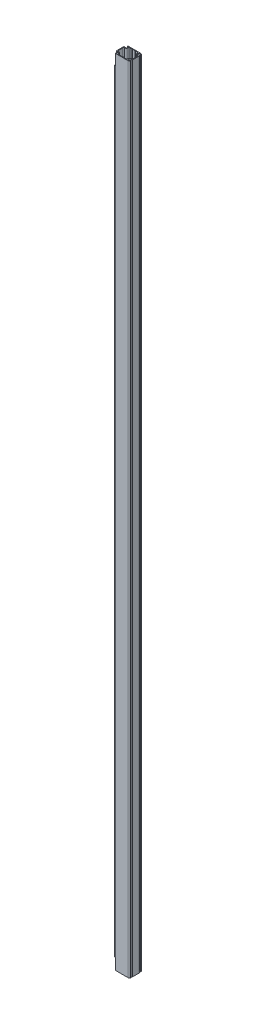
ISO-10303-21;
HEADER;
FILE_DESCRIPTION(('STEP AP214'),'2;1');
FILE_NAME('part.step','',(''),(''),'','','');
FILE_SCHEMA(('AUTOMOTIVE_DESIGN { 1 0 10303 214 1 1 1 1 }'));
ENDSEC;
DATA;
#1=APPLICATION_CONTEXT('core data for automotive mechanical design processes');
#2=APPLICATION_PROTOCOL_DEFINITION('international standard','automotive_design',2000,#1);
#3=PRODUCT_CONTEXT('',#1,'mechanical');
#4=PRODUCT('Part','Part','',(#3));
#5=PRODUCT_RELATED_PRODUCT_CATEGORY('part','',(#4));
#6=PRODUCT_DEFINITION_FORMATION('','',#4);
#7=PRODUCT_DEFINITION_CONTEXT('part definition',#1,'design');
#8=PRODUCT_DEFINITION('design','',#6,#7);
#9=PRODUCT_DEFINITION_SHAPE('','',#8);
#10=(LENGTH_UNIT() NAMED_UNIT(*) SI_UNIT(.MILLI.,.METRE.));
#11=(NAMED_UNIT(*) PLANE_ANGLE_UNIT() SI_UNIT($,.RADIAN.));
#12=(NAMED_UNIT(*) SI_UNIT($,.STERADIAN.) SOLID_ANGLE_UNIT());
#13=UNCERTAINTY_MEASURE_WITH_UNIT(LENGTH_MEASURE(1.E-05),#10,'distance_accuracy_value','');
#14=(GEOMETRIC_REPRESENTATION_CONTEXT(3) GLOBAL_UNCERTAINTY_ASSIGNED_CONTEXT((#13)) GLOBAL_UNIT_ASSIGNED_CONTEXT((#10,
#11,#12)) REPRESENTATION_CONTEXT('',''));
#15=CARTESIAN_POINT('',(0.,0.,0.));
#16=DIRECTION('',(0.,0.,1.));
#17=DIRECTION('',(1.,0.,0.));
#18=AXIS2_PLACEMENT_3D('',#15,#16,#17);
#19=CARTESIAN_POINT('',(-47.386410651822,5000.,44.3252148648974));
#20=DIRECTION('',(0.,-1.,0.));
#21=DIRECTION('',(0.,0.,-1.));
#22=AXIS2_PLACEMENT_3D('',#19,#20,#21);
#23=CYLINDRICAL_SURFACE('',#22,2.);
#24=CARTESIAN_POINT('',(-47.386410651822,70.0000000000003,44.3252148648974));
#25=DIRECTION('',(0.,-1.,0.));
#26=DIRECTION('',(0.,0.,-1.));
#27=AXIS2_PLACEMENT_3D('',#24,#25,#26);
#28=CIRCLE('',#27,2.);
#29=CARTESIAN_POINT('',(-49.2420366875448,70.0000000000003,45.0713060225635));
#30=VERTEX_POINT('',#29);
#31=CARTESIAN_POINT('',(-45.5307846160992,70.0000000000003,43.5791237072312));
#32=VERTEX_POINT('',#31);
#33=EDGE_CURVE('E1157',#30,#32,#28,.T.);
#34=ORIENTED_EDGE('',*,*,#33,.F.);
#35=DIRECTION('',(0.,-1.,0.));
#36=VECTOR('',#35,1.);
#37=CARTESIAN_POINT('',(-49.2420366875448,5000.,45.0713060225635));
#38=LINE('',#37,#36);
#39=CARTESIAN_POINT('',(-49.2420366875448,4930.,45.0713060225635));
#40=VERTEX_POINT('',#39);
#41=EDGE_CURVE('E436',#40,#30,#38,.T.);
#42=ORIENTED_EDGE('',*,*,#41,.F.);
#43=CARTESIAN_POINT('',(-47.386410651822,4930.,44.3252148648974));
#44=DIRECTION('',(0.,-1.,0.));
#45=DIRECTION('',(0.,0.,-1.));
#46=AXIS2_PLACEMENT_3D('',#43,#44,#45);
#47=CIRCLE('',#46,2.);
#48=CARTESIAN_POINT('',(-45.5307846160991,4930.,43.5791237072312));
#49=VERTEX_POINT('',#48);
#50=EDGE_CURVE('E1123',#40,#49,#47,.T.);
#51=ORIENTED_EDGE('',*,*,#50,.T.);
#52=DIRECTION('',(0.,-1.,0.));
#53=VECTOR('',#52,1.);
#54=CARTESIAN_POINT('',(-45.5307846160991,5000.,43.5791237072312));
#55=LINE('',#54,#53);
#56=EDGE_CURVE('E452',#49,#32,#55,.T.);
#57=ORIENTED_EDGE('',*,*,#56,.T.);
#58=EDGE_LOOP('',(#34,#42,#51,#57));
#59=FACE_BOUND('',#58,.T.);
#60=ADVANCED_FACE('F41',(#59),#23,.T.);
#61=CARTESIAN_POINT('',(-39.5,5000.,41.1543274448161));
#62=DIRECTION('',(0.,-1.,0.));
#63=DIRECTION('',(0.,0.,-1.));
#64=AXIS2_PLACEMENT_3D('',#61,#62,#63);
#65=CYLINDRICAL_SURFACE('',#64,10.5);
#66=CARTESIAN_POINT('',(-39.5,70.0000000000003,41.1543274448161));
#67=DIRECTION('',(0.,-1.,0.));
#68=DIRECTION('',(0.,0.,-1.));
#69=AXIS2_PLACEMENT_3D('',#66,#67,#68);
#70=CIRCLE('',#69,10.5);
#71=CARTESIAN_POINT('',(-39.5,70.,51.6543274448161));
#72=VERTEX_POINT('',#71);
#73=EDGE_CURVE('E50',#72,#30,#70,.T.);
#74=ORIENTED_EDGE('',*,*,#73,.F.);
#75=DIRECTION('',(0.,-1.,0.));
#76=VECTOR('',#75,1.);
#77=CARTESIAN_POINT('',(-39.5,5000.,51.6543274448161));
#78=LINE('',#77,#76);
#79=CARTESIAN_POINT('',(-39.5,4930.,51.6543274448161));
#80=VERTEX_POINT('',#79);
#81=EDGE_CURVE('E433',#80,#72,#78,.T.);
#82=ORIENTED_EDGE('',*,*,#81,.F.);
#83=CARTESIAN_POINT('',(-39.5,4930.,41.1543274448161));
#84=DIRECTION('',(0.,-1.,0.));
#85=DIRECTION('',(0.,0.,-1.));
#86=AXIS2_PLACEMENT_3D('',#83,#84,#85);
#87=CIRCLE('',#86,10.5);
#88=EDGE_CURVE('E482',#80,#40,#87,.T.);
#89=ORIENTED_EDGE('',*,*,#88,.T.);
#90=ORIENTED_EDGE('',*,*,#41,.T.);
#91=EDGE_LOOP('',(#74,#82,#89,#90));
#92=FACE_BOUND('',#91,.T.);
#93=ADVANCED_FACE('F431',(#92),#65,.T.);
#94=CARTESIAN_POINT('',(-39.5,5000.,-17.8456725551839));
#95=DIRECTION('',(0.,-1.,0.));
#96=DIRECTION('',(0.,0.,-1.));
#97=AXIS2_PLACEMENT_3D('',#94,#95,#96);
#98=CYLINDRICAL_SURFACE('',#97,10.5);
#99=CARTESIAN_POINT('',(-39.5,70.0000000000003,-17.8456725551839));
#100=DIRECTION('',(0.,1.,0.));
#101=DIRECTION('',(0.,0.,1.));
#102=AXIS2_PLACEMENT_3D('',#99,#100,#101);
#103=CIRCLE('',#102,10.5);
#104=CARTESIAN_POINT('',(-49.2420366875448,70.0000000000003,-21.7626511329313));
#105=VERTEX_POINT('',#104);
#106=CARTESIAN_POINT('',(-39.5,70.,-28.3456725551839));
#107=VERTEX_POINT('',#106);
#108=EDGE_CURVE('E1098',#105,#107,#103,.F.);
#109=ORIENTED_EDGE('',*,*,#108,.F.);
#110=DIRECTION('',(0.,-1.,0.));
#111=VECTOR('',#110,1.);
#112=CARTESIAN_POINT('',(-49.2420366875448,5000.,-21.7626511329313));
#113=LINE('',#112,#111);
#114=CARTESIAN_POINT('',(-49.2420366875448,4930.,-21.7626511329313));
#115=VERTEX_POINT('',#114);
#116=EDGE_CURVE('E474',#115,#105,#113,.T.);
#117=ORIENTED_EDGE('',*,*,#116,.F.);
#118=CARTESIAN_POINT('',(-39.5,4930.,-17.8456725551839));
#119=DIRECTION('',(0.,1.,0.));
#120=DIRECTION('',(0.,0.,1.));
#121=AXIS2_PLACEMENT_3D('',#118,#119,#120);
#122=CIRCLE('',#121,10.5);
#123=CARTESIAN_POINT('',(-39.5,4930.,-28.3456725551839));
#124=VERTEX_POINT('',#123);
#125=EDGE_CURVE('E987',#115,#124,#122,.F.);
#126=ORIENTED_EDGE('',*,*,#125,.T.);
#127=DIRECTION('',(0.,-1.,0.));
#128=VECTOR('',#127,1.);
#129=CARTESIAN_POINT('',(-39.5,5000.,-28.3456725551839));
#130=LINE('',#129,#128);
#131=EDGE_CURVE('E781',#124,#107,#130,.T.);
#132=ORIENTED_EDGE('',*,*,#131,.T.);
#133=EDGE_LOOP('',(#109,#117,#126,#132));
#134=FACE_BOUND('',#133,.T.);
#135=ADVANCED_FACE('F43',(#134),#98,.T.);
#136=CARTESIAN_POINT('',(-47.386410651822,5000.,-21.0165599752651));
#137=DIRECTION('',(0.,-1.,0.));
#138=DIRECTION('',(0.,0.,-1.));
#139=AXIS2_PLACEMENT_3D('',#136,#137,#138);
#140=CYLINDRICAL_SURFACE('',#139,2.);
#141=CARTESIAN_POINT('',(-47.386410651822,70.0000000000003,-21.0165599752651));
#142=DIRECTION('',(0.,1.,0.));
#143=DIRECTION('',(0.,0.,1.));
#144=AXIS2_PLACEMENT_3D('',#141,#142,#143);
#145=CIRCLE('',#144,2.);
#146=CARTESIAN_POINT('',(-45.5307846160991,70.0000000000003,-20.2704688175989));
#147=VERTEX_POINT('',#146);
#148=EDGE_CURVE('E1092',#147,#105,#145,.F.);
#149=ORIENTED_EDGE('',*,*,#148,.F.);
#150=DIRECTION('',(0.,-1.,0.));
#151=VECTOR('',#150,1.);
#152=CARTESIAN_POINT('',(-45.5307846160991,5000.,-20.2704688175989));
#153=LINE('',#152,#151);
#154=CARTESIAN_POINT('',(-45.5307846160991,4930.,-20.2704688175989));
#155=VERTEX_POINT('',#154);
#156=EDGE_CURVE('E470',#155,#147,#153,.T.);
#157=ORIENTED_EDGE('',*,*,#156,.F.);
#158=CARTESIAN_POINT('',(-47.386410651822,4930.,-21.0165599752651));
#159=DIRECTION('',(0.,1.,0.));
#160=DIRECTION('',(0.,0.,1.));
#161=AXIS2_PLACEMENT_3D('',#158,#159,#160);
#162=CIRCLE('',#161,2.);
#163=EDGE_CURVE('E1104',#155,#115,#162,.F.);
#164=ORIENTED_EDGE('',*,*,#163,.T.);
#165=ORIENTED_EDGE('',*,*,#116,.T.);
#166=EDGE_LOOP('',(#149,#157,#164,#165));
#167=FACE_BOUND('',#166,.T.);
#168=ADVANCED_FACE('F1078',(#167),#140,.T.);
#169=CARTESIAN_POINT('',(-39.5,5000.,-17.8456725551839));
#170=DIRECTION('',(0.,-1.,0.));
#171=DIRECTION('',(0.,0.,-1.));
#172=AXIS2_PLACEMENT_3D('',#169,#170,#171);
#173=CYLINDRICAL_SURFACE('',#172,10.5);
#174=CARTESIAN_POINT('',(-39.5,0.,-17.8456725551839));
#175=DIRECTION('',(0.,1.,0.));
#176=DIRECTION('',(0.,0.,1.));
#177=AXIS2_PLACEMENT_3D('',#174,#175,#176);
#178=CIRCLE('',#177,10.5);
#179=CARTESIAN_POINT('',(-29.,0.,-17.8456725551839));
#180=VERTEX_POINT('',#179);
#181=CARTESIAN_POINT('',(-39.5,0.,-7.34567255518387));
#182=VERTEX_POINT('',#181);
#183=EDGE_CURVE('E549',#180,#182,#178,.F.);
#184=ORIENTED_EDGE('',*,*,#183,.F.);
#185=DIRECTION('',(0.,-1.,0.));
#186=VECTOR('',#185,1.);
#187=CARTESIAN_POINT('',(-29.,5000.,-17.8456725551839));
#188=LINE('',#187,#186);
#189=CARTESIAN_POINT('',(-29.,5000.,-17.8456725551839));
#190=VERTEX_POINT('',#189);
#191=EDGE_CURVE('E483',#190,#180,#188,.T.);
#192=ORIENTED_EDGE('',*,*,#191,.F.);
#193=CARTESIAN_POINT('',(-39.5,5000.,-17.8456725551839));
#194=DIRECTION('',(0.,1.,0.));
#195=DIRECTION('',(0.,0.,1.));
#196=AXIS2_PLACEMENT_3D('',#193,#194,#195);
#197=CIRCLE('',#196,10.5);
#198=CARTESIAN_POINT('',(-39.5,5000.,-7.34567255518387));
#199=VERTEX_POINT('',#198);
#200=EDGE_CURVE('E865',#190,#199,#197,.F.);
#201=ORIENTED_EDGE('',*,*,#200,.T.);
#202=DIRECTION('',(0.,-1.,0.));
#203=VECTOR('',#202,1.);
#204=CARTESIAN_POINT('',(-39.5,5000.,-7.34567255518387));
#205=LINE('',#204,#203);
#206=EDGE_CURVE('E478',#199,#182,#205,.T.);
#207=ORIENTED_EDGE('',*,*,#206,.T.);
#208=EDGE_LOOP('',(#184,#192,#201,#207));
#209=FACE_BOUND('',#208,.T.);
#210=ADVANCED_FACE('F1080',(#209),#173,.T.);
#211=CARTESIAN_POINT('',(-22.5,5000.,-17.8456725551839));
#212=DIRECTION('',(0.,-1.,0.));
#213=DIRECTION('',(0.,0.,-1.));
#214=AXIS2_PLACEMENT_3D('',#211,#212,#213);
#215=CYLINDRICAL_SURFACE('',#214,6.49999999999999);
#216=CARTESIAN_POINT('',(-22.5,0.,-17.8456725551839));
#217=DIRECTION('',(0.,1.,0.));
#218=DIRECTION('',(0.,0.,1.));
#219=AXIS2_PLACEMENT_3D('',#216,#217,#218);
#220=CIRCLE('',#219,6.49999999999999);
#221=CARTESIAN_POINT('',(-22.5,0.,-24.3456725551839));
#222=VERTEX_POINT('',#221);
#223=EDGE_CURVE('E553',#180,#222,#220,.F.);
#224=ORIENTED_EDGE('',*,*,#223,.T.);
#225=DIRECTION('',(0.,-1.,0.));
#226=VECTOR('',#225,1.);
#227=CARTESIAN_POINT('',(-22.5,5000.,-24.3456725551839));
#228=LINE('',#227,#226);
#229=CARTESIAN_POINT('',(-22.5,5000.,-24.3456725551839));
#230=VERTEX_POINT('',#229);
#231=EDGE_CURVE('E770',#230,#222,#228,.T.);
#232=ORIENTED_EDGE('',*,*,#231,.F.);
#233=CARTESIAN_POINT('',(-22.5,5000.,-17.8456725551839));
#234=DIRECTION('',(0.,1.,0.));
#235=DIRECTION('',(0.,0.,1.));
#236=AXIS2_PLACEMENT_3D('',#233,#234,#235);
#237=CIRCLE('',#236,6.49999999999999);
#238=EDGE_CURVE('E869',#190,#230,#237,.F.);
#239=ORIENTED_EDGE('',*,*,#238,.F.);
#240=ORIENTED_EDGE('',*,*,#191,.T.);
#241=EDGE_LOOP('',(#224,#232,#239,#240));
#242=FACE_BOUND('',#241,.T.);
#243=ADVANCED_FACE('F1086',(#242),#215,.F.);
#244=CARTESIAN_POINT('',(0.,5000.,-24.3456725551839));
#245=DIRECTION('',(0.,0.,-1.));
#246=DIRECTION('',(-1.,0.,0.));
#247=AXIS2_PLACEMENT_3D('',#244,#245,#246);
#248=PLANE('',#247);
#249=DIRECTION('',(1.,0.,0.));
#250=VECTOR('',#249,1.);
#251=CARTESIAN_POINT('',(0.,0.,-24.3456725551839));
#252=LINE('',#251,#250);
#253=CARTESIAN_POINT('',(-12.5,0.,-24.3456725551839));
#254=VERTEX_POINT('',#253);
#255=EDGE_CURVE('E557',#222,#254,#252,.T.);
#256=ORIENTED_EDGE('',*,*,#255,.T.);
#257=DIRECTION('',(0.,-1.,0.));
#258=VECTOR('',#257,1.);
#259=CARTESIAN_POINT('',(-12.5,5000.,-24.3456725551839));
#260=LINE('',#259,#258);
#261=CARTESIAN_POINT('',(-12.5,5000.,-24.3456725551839));
#262=VERTEX_POINT('',#261);
#263=EDGE_CURVE('E767',#262,#254,#260,.T.);
#264=ORIENTED_EDGE('',*,*,#263,.F.);
#265=DIRECTION('',(1.,0.,0.));
#266=VECTOR('',#265,1.);
#267=CARTESIAN_POINT('',(0.,5000.,-24.3456725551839));
#268=LINE('',#267,#266);
#269=EDGE_CURVE('E873',#230,#262,#268,.T.);
#270=ORIENTED_EDGE('',*,*,#269,.F.);
#271=ORIENTED_EDGE('',*,*,#231,.T.);
#272=EDGE_LOOP('',(#256,#264,#270,#271));
#273=FACE_BOUND('',#272,.T.);
#274=ADVANCED_FACE('F1308',(#273),#248,.F.);
#275=CARTESIAN_POINT('',(5.92283627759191,5000.,-5.9228362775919));
#276=DIRECTION('',(-0.707106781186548,0.,0.707106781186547));
#277=DIRECTION('',(0.707106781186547,0.,0.707106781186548));
#278=AXIS2_PLACEMENT_3D('',#275,#276,#277);
#279=PLANE('',#278);
#280=DIRECTION('',(-0.707106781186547,0.,-0.707106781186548));
#281=VECTOR('',#280,1.);
#282=CARTESIAN_POINT('',(5.92283627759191,0.,-5.9228362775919));
#283=LINE('',#282,#281);
#284=CARTESIAN_POINT('',(-11.,0.,-22.8456725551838));
#285=VERTEX_POINT('',#284);
#286=EDGE_CURVE('E561',#285,#254,#283,.T.);
#287=ORIENTED_EDGE('',*,*,#286,.F.);
#288=DIRECTION('',(0.,-1.,0.));
#289=VECTOR('',#288,1.);
#290=CARTESIAN_POINT('',(-11.,5000.,-22.8456725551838));
#291=LINE('',#290,#289);
#292=CARTESIAN_POINT('',(-11.,5000.,-22.8456725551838));
#293=VERTEX_POINT('',#292);
#294=EDGE_CURVE('E764',#293,#285,#291,.T.);
#295=ORIENTED_EDGE('',*,*,#294,.F.);
#296=DIRECTION('',(-0.707106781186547,0.,-0.707106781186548));
#297=VECTOR('',#296,1.);
#298=CARTESIAN_POINT('',(5.92283627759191,5000.,-5.9228362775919));
#299=LINE('',#298,#297);
#300=EDGE_CURVE('E876',#293,#262,#299,.T.);
#301=ORIENTED_EDGE('',*,*,#300,.T.);
#302=ORIENTED_EDGE('',*,*,#263,.T.);
#303=EDGE_LOOP('',(#287,#295,#301,#302));
#304=FACE_BOUND('',#303,.T.);
#305=ADVANCED_FACE('F1304',(#304),#279,.T.);
#306=CARTESIAN_POINT('',(0.,5000.,-22.8456725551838));
#307=DIRECTION('',(0.,0.,-1.));
#308=DIRECTION('',(-1.,0.,0.));
#309=AXIS2_PLACEMENT_3D('',#306,#307,#308);
#310=PLANE('',#309);
#311=DIRECTION('',(1.,0.,0.));
#312=VECTOR('',#311,1.);
#313=CARTESIAN_POINT('',(0.,0.,-22.8456725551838));
#314=LINE('',#313,#312);
#315=CARTESIAN_POINT('',(-8.,0.,-22.8456725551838));
#316=VERTEX_POINT('',#315);
#317=EDGE_CURVE('E565',#285,#316,#314,.T.);
#318=ORIENTED_EDGE('',*,*,#317,.T.);
#319=DIRECTION('',(0.,-1.,0.));
#320=VECTOR('',#319,1.);
#321=CARTESIAN_POINT('',(-8.,5000.,-22.8456725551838));
#322=LINE('',#321,#320);
#323=CARTESIAN_POINT('',(-8.,5000.,-22.8456725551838));
#324=VERTEX_POINT('',#323);
#325=EDGE_CURVE('E760',#324,#316,#322,.T.);
#326=ORIENTED_EDGE('',*,*,#325,.F.);
#327=DIRECTION('',(1.,0.,0.));
#328=VECTOR('',#327,1.);
#329=CARTESIAN_POINT('',(0.,5000.,-22.8456725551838));
#330=LINE('',#329,#328);
#331=EDGE_CURVE('E880',#293,#324,#330,.T.);
#332=ORIENTED_EDGE('',*,*,#331,.F.);
#333=ORIENTED_EDGE('',*,*,#294,.T.);
#334=EDGE_LOOP('',(#318,#326,#332,#333));
#335=FACE_BOUND('',#334,.T.);
#336=ADVANCED_FACE('F1300',(#335),#310,.F.);
#337=CARTESIAN_POINT('',(-15.4228362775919,5000.,-15.422836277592));
#338=DIRECTION('',(-0.707106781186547,0.,-0.707106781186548));
#339=DIRECTION('',(-0.707106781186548,0.,0.707106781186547));
#340=AXIS2_PLACEMENT_3D('',#337,#338,#339);
#341=PLANE('',#340);
#342=DIRECTION('',(0.707106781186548,0.,-0.707106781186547));
#343=VECTOR('',#342,1.);
#344=CARTESIAN_POINT('',(-15.4228362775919,0.,-15.422836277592));
#345=LINE('',#344,#343);
#346=CARTESIAN_POINT('',(-6.50000000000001,0.,-24.3456725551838));
#347=VERTEX_POINT('',#346);
#348=EDGE_CURVE('E569',#316,#347,#345,.T.);
#349=ORIENTED_EDGE('',*,*,#348,.T.);
#350=DIRECTION('',(0.,-1.,0.));
#351=VECTOR('',#350,1.);
#352=CARTESIAN_POINT('',(-6.50000000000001,5000.,-24.3456725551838));
#353=LINE('',#352,#351);
#354=CARTESIAN_POINT('',(-6.50000000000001,5000.,-24.3456725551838));
#355=VERTEX_POINT('',#354);
#356=EDGE_CURVE('E757',#355,#347,#353,.T.);
#357=ORIENTED_EDGE('',*,*,#356,.F.);
#358=DIRECTION('',(0.707106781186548,0.,-0.707106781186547));
#359=VECTOR('',#358,1.);
#360=CARTESIAN_POINT('',(-15.4228362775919,5000.,-15.422836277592));
#361=LINE('',#360,#359);
#362=EDGE_CURVE('E884',#324,#355,#361,.T.);
#363=ORIENTED_EDGE('',*,*,#362,.F.);
#364=ORIENTED_EDGE('',*,*,#325,.T.);
#365=EDGE_LOOP('',(#349,#357,#363,#364));
#366=FACE_BOUND('',#365,.T.);
#367=ADVANCED_FACE('F1296',(#366),#341,.F.);
#368=CARTESIAN_POINT('',(0.,5000.,-24.3456725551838));
#369=DIRECTION('',(0.,0.,1.));
#370=DIRECTION('',(1.,0.,0.));
#371=AXIS2_PLACEMENT_3D('',#368,#369,#370);
#372=PLANE('',#371);
#373=DIRECTION('',(-1.,0.,0.));
#374=VECTOR('',#373,1.);
#375=CARTESIAN_POINT('',(0.,0.,-24.3456725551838));
#376=LINE('',#375,#374);
#377=CARTESIAN_POINT('',(6.50000000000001,0.,-24.3456725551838));
#378=VERTEX_POINT('',#377);
#379=EDGE_CURVE('E573',#378,#347,#376,.T.);
#380=ORIENTED_EDGE('',*,*,#379,.F.);
#381=DIRECTION('',(0.,-1.,0.));
#382=VECTOR('',#381,1.);
#383=CARTESIAN_POINT('',(6.50000000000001,5000.,-24.3456725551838));
#384=LINE('',#383,#382);
#385=CARTESIAN_POINT('',(6.50000000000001,5000.,-24.3456725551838));
#386=VERTEX_POINT('',#385);
#387=EDGE_CURVE('E754',#386,#378,#384,.T.);
#388=ORIENTED_EDGE('',*,*,#387,.F.);
#389=DIRECTION('',(-1.,0.,0.));
#390=VECTOR('',#389,1.);
#391=CARTESIAN_POINT('',(0.,5000.,-24.3456725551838));
#392=LINE('',#391,#390);
#393=EDGE_CURVE('E887',#386,#355,#392,.T.);
#394=ORIENTED_EDGE('',*,*,#393,.T.);
#395=ORIENTED_EDGE('',*,*,#356,.T.);
#396=EDGE_LOOP('',(#380,#388,#394,#395));
#397=FACE_BOUND('',#396,.T.);
#398=ADVANCED_FACE('F1292',(#397),#372,.T.);
#399=CARTESIAN_POINT('',(15.4228362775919,5000.,-15.422836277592));
#400=DIRECTION('',(-0.707106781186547,0.,0.707106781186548));
#401=DIRECTION('',(0.707106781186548,0.,0.707106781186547));
#402=AXIS2_PLACEMENT_3D('',#399,#400,#401);
#403=PLANE('',#402);
#404=DIRECTION('',(-0.707106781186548,0.,-0.707106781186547));
#405=VECTOR('',#404,1.);
#406=CARTESIAN_POINT('',(15.4228362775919,0.,-15.422836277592));
#407=LINE('',#406,#405);
#408=CARTESIAN_POINT('',(8.,0.,-22.8456725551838));
#409=VERTEX_POINT('',#408);
#410=EDGE_CURVE('E577',#409,#378,#407,.T.);
#411=ORIENTED_EDGE('',*,*,#410,.F.);
#412=DIRECTION('',(0.,-1.,0.));
#413=VECTOR('',#412,1.);
#414=CARTESIAN_POINT('',(8.,5000.,-22.8456725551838));
#415=LINE('',#414,#413);
#416=CARTESIAN_POINT('',(8.,5000.,-22.8456725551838));
#417=VERTEX_POINT('',#416);
#418=EDGE_CURVE('E751',#417,#409,#415,.T.);
#419=ORIENTED_EDGE('',*,*,#418,.F.);
#420=DIRECTION('',(-0.707106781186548,0.,-0.707106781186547));
#421=VECTOR('',#420,1.);
#422=CARTESIAN_POINT('',(15.4228362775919,5000.,-15.422836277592));
#423=LINE('',#422,#421);
#424=EDGE_CURVE('E891',#417,#386,#423,.T.);
#425=ORIENTED_EDGE('',*,*,#424,.T.);
#426=ORIENTED_EDGE('',*,*,#387,.T.);
#427=EDGE_LOOP('',(#411,#419,#425,#426));
#428=FACE_BOUND('',#427,.T.);
#429=ADVANCED_FACE('F1288',(#428),#403,.T.);
#430=CARTESIAN_POINT('',(0.,5000.,-22.8456725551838));
#431=DIRECTION('',(0.,0.,1.));
#432=DIRECTION('',(1.,0.,0.));
#433=AXIS2_PLACEMENT_3D('',#430,#431,#432);
#434=PLANE('',#433);
#435=DIRECTION('',(-1.,0.,0.));
#436=VECTOR('',#435,1.);
#437=CARTESIAN_POINT('',(0.,0.,-22.8456725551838));
#438=LINE('',#437,#436);
#439=CARTESIAN_POINT('',(11.,0.,-22.8456725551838));
#440=VERTEX_POINT('',#439);
#441=EDGE_CURVE('E581',#440,#409,#438,.T.);
#442=ORIENTED_EDGE('',*,*,#441,.F.);
#443=DIRECTION('',(0.,-1.,0.));
#444=VECTOR('',#443,1.);
#445=CARTESIAN_POINT('',(11.,5000.,-22.8456725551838));
#446=LINE('',#445,#444);
#447=CARTESIAN_POINT('',(11.,5000.,-22.8456725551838));
#448=VERTEX_POINT('',#447);
#449=EDGE_CURVE('E748',#448,#440,#446,.T.);
#450=ORIENTED_EDGE('',*,*,#449,.F.);
#451=DIRECTION('',(-1.,0.,0.));
#452=VECTOR('',#451,1.);
#453=CARTESIAN_POINT('',(0.,5000.,-22.8456725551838));
#454=LINE('',#453,#452);
#455=EDGE_CURVE('E895',#448,#417,#454,.T.);
#456=ORIENTED_EDGE('',*,*,#455,.T.);
#457=ORIENTED_EDGE('',*,*,#418,.T.);
#458=EDGE_LOOP('',(#442,#450,#456,#457));
#459=FACE_BOUND('',#458,.T.);
#460=ADVANCED_FACE('F1284',(#459),#434,.T.);
#461=CARTESIAN_POINT('',(-5.92283627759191,5000.,-5.9228362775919));
#462=DIRECTION('',(-0.707106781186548,0.,-0.707106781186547));
#463=DIRECTION('',(-0.707106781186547,0.,0.707106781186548));
#464=AXIS2_PLACEMENT_3D('',#461,#462,#463);
#465=PLANE('',#464);
#466=DIRECTION('',(0.707106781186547,0.,-0.707106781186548));
#467=VECTOR('',#466,1.);
#468=CARTESIAN_POINT('',(-5.92283627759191,0.,-5.9228362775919));
#469=LINE('',#468,#467);
#470=CARTESIAN_POINT('',(12.5,0.,-24.3456725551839));
#471=VERTEX_POINT('',#470);
#472=EDGE_CURVE('E585',#440,#471,#469,.T.);
#473=ORIENTED_EDGE('',*,*,#472,.T.);
#474=DIRECTION('',(0.,-1.,0.));
#475=VECTOR('',#474,1.);
#476=CARTESIAN_POINT('',(12.5,5000.,-24.3456725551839));
#477=LINE('',#476,#475);
#478=CARTESIAN_POINT('',(12.5,5000.,-24.3456725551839));
#479=VERTEX_POINT('',#478);
#480=EDGE_CURVE('E745',#479,#471,#477,.T.);
#481=ORIENTED_EDGE('',*,*,#480,.F.);
#482=DIRECTION('',(0.707106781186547,0.,-0.707106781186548));
#483=VECTOR('',#482,1.);
#484=CARTESIAN_POINT('',(-5.92283627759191,5000.,-5.9228362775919));
#485=LINE('',#484,#483);
#486=EDGE_CURVE('E899',#448,#479,#485,.T.);
#487=ORIENTED_EDGE('',*,*,#486,.F.);
#488=ORIENTED_EDGE('',*,*,#449,.T.);
#489=EDGE_LOOP('',(#473,#481,#487,#488));
#490=FACE_BOUND('',#489,.T.);
#491=ADVANCED_FACE('F1280',(#490),#465,.F.);
#492=CARTESIAN_POINT('',(0.,5000.,-24.3456725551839));
#493=DIRECTION('',(0.,0.,1.));
#494=DIRECTION('',(1.,0.,0.));
#495=AXIS2_PLACEMENT_3D('',#492,#493,#494);
#496=PLANE('',#495);
#497=DIRECTION('',(-1.,0.,0.));
#498=VECTOR('',#497,1.);
#499=CARTESIAN_POINT('',(0.,0.,-24.3456725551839));
#500=LINE('',#499,#498);
#501=CARTESIAN_POINT('',(22.5,0.,-24.3456725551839));
#502=VERTEX_POINT('',#501);
#503=EDGE_CURVE('E589',#502,#471,#500,.T.);
#504=ORIENTED_EDGE('',*,*,#503,.F.);
#505=DIRECTION('',(0.,-1.,0.));
#506=VECTOR('',#505,1.);
#507=CARTESIAN_POINT('',(22.5,5000.,-24.3456725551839));
#508=LINE('',#507,#506);
#509=CARTESIAN_POINT('',(22.5,5000.,-24.3456725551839));
#510=VERTEX_POINT('',#509);
#511=EDGE_CURVE('E742',#510,#502,#508,.T.);
#512=ORIENTED_EDGE('',*,*,#511,.F.);
#513=DIRECTION('',(-1.,0.,0.));
#514=VECTOR('',#513,1.);
#515=CARTESIAN_POINT('',(0.,5000.,-24.3456725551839));
#516=LINE('',#515,#514);
#517=EDGE_CURVE('E902',#510,#479,#516,.T.);
#518=ORIENTED_EDGE('',*,*,#517,.T.);
#519=ORIENTED_EDGE('',*,*,#480,.T.);
#520=EDGE_LOOP('',(#504,#512,#518,#519));
#521=FACE_BOUND('',#520,.T.);
#522=ADVANCED_FACE('F1276',(#521),#496,.T.);
#523=CARTESIAN_POINT('',(22.5,5000.,-17.8456725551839));
#524=DIRECTION('',(0.,-1.,0.));
#525=DIRECTION('',(0.,0.,-1.));
#526=AXIS2_PLACEMENT_3D('',#523,#524,#525);
#527=CYLINDRICAL_SURFACE('',#526,6.49999999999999);
#528=CARTESIAN_POINT('',(22.5,0.,-17.8456725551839));
#529=DIRECTION('',(0.,1.,0.));
#530=DIRECTION('',(0.,0.,1.));
#531=AXIS2_PLACEMENT_3D('',#528,#529,#530);
#532=CIRCLE('',#531,6.49999999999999);
#533=CARTESIAN_POINT('',(29.,0.,-17.8456725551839));
#534=VERTEX_POINT('',#533);
#535=EDGE_CURVE('E593',#534,#502,#532,.T.);
#536=ORIENTED_EDGE('',*,*,#535,.F.);
#537=DIRECTION('',(0.,-1.,0.));
#538=VECTOR('',#537,1.);
#539=CARTESIAN_POINT('',(29.,5000.,-17.8456725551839));
#540=LINE('',#539,#538);
#541=CARTESIAN_POINT('',(29.,5000.,-17.8456725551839));
#542=VERTEX_POINT('',#541);
#543=EDGE_CURVE('E739',#542,#534,#540,.T.);
#544=ORIENTED_EDGE('',*,*,#543,.F.);
#545=CARTESIAN_POINT('',(22.5,5000.,-17.8456725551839));
#546=DIRECTION('',(0.,1.,0.));
#547=DIRECTION('',(0.,0.,1.));
#548=AXIS2_PLACEMENT_3D('',#545,#546,#547);
#549=CIRCLE('',#548,6.49999999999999);
#550=EDGE_CURVE('E906',#542,#510,#549,.T.);
#551=ORIENTED_EDGE('',*,*,#550,.T.);
#552=ORIENTED_EDGE('',*,*,#511,.T.);
#553=EDGE_LOOP('',(#536,#544,#551,#552));
#554=FACE_BOUND('',#553,.T.);
#555=ADVANCED_FACE('F1272',(#554),#527,.F.);
#556=CARTESIAN_POINT('',(39.5,5000.,-17.8456725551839));
#557=DIRECTION('',(0.,-1.,0.));
#558=DIRECTION('',(0.,0.,-1.));
#559=AXIS2_PLACEMENT_3D('',#556,#557,#558);
#560=CYLINDRICAL_SURFACE('',#559,10.5);
#561=CARTESIAN_POINT('',(39.5,0.,-17.8456725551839));
#562=DIRECTION('',(0.,1.,0.));
#563=DIRECTION('',(0.,0.,1.));
#564=AXIS2_PLACEMENT_3D('',#561,#562,#563);
#565=CIRCLE('',#564,10.5);
#566=CARTESIAN_POINT('',(39.5,0.,-7.34567255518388));
#567=VERTEX_POINT('',#566);
#568=EDGE_CURVE('E597',#534,#567,#565,.T.);
#569=ORIENTED_EDGE('',*,*,#568,.T.);
#570=DIRECTION('',(0.,-1.,0.));
#571=VECTOR('',#570,1.);
#572=CARTESIAN_POINT('',(39.5,5000.,-7.34567255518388));
#573=LINE('',#572,#571);
#574=CARTESIAN_POINT('',(39.5,5000.,-7.34567255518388));
#575=VERTEX_POINT('',#574);
#576=EDGE_CURVE('E736',#575,#567,#573,.T.);
#577=ORIENTED_EDGE('',*,*,#576,.F.);
#578=CARTESIAN_POINT('',(39.5,5000.,-17.8456725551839));
#579=DIRECTION('',(0.,1.,0.));
#580=DIRECTION('',(0.,0.,1.));
#581=AXIS2_PLACEMENT_3D('',#578,#579,#580);
#582=CIRCLE('',#581,10.5);
#583=EDGE_CURVE('E910',#542,#575,#582,.T.);
#584=ORIENTED_EDGE('',*,*,#583,.F.);
#585=ORIENTED_EDGE('',*,*,#543,.T.);
#586=EDGE_LOOP('',(#569,#577,#584,#585));
#587=FACE_BOUND('',#586,.T.);
#588=ADVANCED_FACE('F1268',(#587),#560,.T.);
#589=CARTESIAN_POINT('',(39.5,5000.,-0.845672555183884));
#590=DIRECTION('',(0.,-1.,0.));
#591=DIRECTION('',(0.,0.,-1.));
#592=AXIS2_PLACEMENT_3D('',#589,#590,#591);
#593=CYLINDRICAL_SURFACE('',#592,6.49999999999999);
#594=CARTESIAN_POINT('',(39.5,0.,-0.845672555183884));
#595=DIRECTION('',(0.,1.,0.));
#596=DIRECTION('',(0.,0.,1.));
#597=AXIS2_PLACEMENT_3D('',#594,#595,#596);
#598=CIRCLE('',#597,6.49999999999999);
#599=CARTESIAN_POINT('',(46.,0.,-0.845672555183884));
#600=VERTEX_POINT('',#599);
#601=EDGE_CURVE('E601',#600,#567,#598,.T.);
#602=ORIENTED_EDGE('',*,*,#601,.F.);
#603=DIRECTION('',(0.,-1.,0.));
#604=VECTOR('',#603,1.);
#605=CARTESIAN_POINT('',(46.,5000.,-0.845672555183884));
#606=LINE('',#605,#604);
#607=CARTESIAN_POINT('',(46.,5000.,-0.845672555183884));
#608=VERTEX_POINT('',#607);
#609=EDGE_CURVE('E733',#608,#600,#606,.T.);
#610=ORIENTED_EDGE('',*,*,#609,.F.);
#611=CARTESIAN_POINT('',(39.5,5000.,-0.845672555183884));
#612=DIRECTION('',(0.,1.,0.));
#613=DIRECTION('',(0.,0.,1.));
#614=AXIS2_PLACEMENT_3D('',#611,#612,#613);
#615=CIRCLE('',#614,6.49999999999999);
#616=EDGE_CURVE('E913',#608,#575,#615,.T.);
#617=ORIENTED_EDGE('',*,*,#616,.T.);
#618=ORIENTED_EDGE('',*,*,#576,.T.);
#619=EDGE_LOOP('',(#602,#610,#617,#618));
#620=FACE_BOUND('',#619,.T.);
#621=ADVANCED_FACE('F1264',(#620),#593,.F.);
#622=CARTESIAN_POINT('',(46.,5000.,0.));
#623=DIRECTION('',(-1.,0.,0.));
#624=DIRECTION('',(0.,0.,1.));
#625=AXIS2_PLACEMENT_3D('',#622,#623,#624);
#626=PLANE('',#625);
#627=DIRECTION('',(0.,0.,-1.));
#628=VECTOR('',#627,1.);
#629=CARTESIAN_POINT('',(46.,0.,0.));
#630=LINE('',#629,#628);
#631=CARTESIAN_POINT('',(46.,0.,24.1543274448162));
#632=VERTEX_POINT('',#631);
#633=EDGE_CURVE('E605',#632,#600,#630,.T.);
#634=ORIENTED_EDGE('',*,*,#633,.F.);
#635=DIRECTION('',(0.,-1.,0.));
#636=VECTOR('',#635,1.);
#637=CARTESIAN_POINT('',(46.,5000.,24.1543274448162));
#638=LINE('',#637,#636);
#639=CARTESIAN_POINT('',(46.,5000.,24.1543274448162));
#640=VERTEX_POINT('',#639);
#641=EDGE_CURVE('E730',#640,#632,#638,.T.);
#642=ORIENTED_EDGE('',*,*,#641,.F.);
#643=DIRECTION('',(0.,0.,-1.));
#644=VECTOR('',#643,1.);
#645=CARTESIAN_POINT('',(46.,5000.,0.));
#646=LINE('',#645,#644);
#647=EDGE_CURVE('E917',#640,#608,#646,.T.);
#648=ORIENTED_EDGE('',*,*,#647,.T.);
#649=ORIENTED_EDGE('',*,*,#609,.T.);
#650=EDGE_LOOP('',(#634,#642,#648,#649));
#651=FACE_BOUND('',#650,.T.);
#652=ADVANCED_FACE('F1260',(#651),#626,.T.);
#653=CARTESIAN_POINT('',(39.5,5000.,24.1543274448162));
#654=DIRECTION('',(0.,-1.,0.));
#655=DIRECTION('',(0.,0.,-1.));
#656=AXIS2_PLACEMENT_3D('',#653,#654,#655);
#657=CYLINDRICAL_SURFACE('',#656,6.49999999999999);
#658=CARTESIAN_POINT('',(39.5,0.,24.1543274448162));
#659=DIRECTION('',(0.,1.,0.));
#660=DIRECTION('',(0.,0.,1.));
#661=AXIS2_PLACEMENT_3D('',#658,#659,#660);
#662=CIRCLE('',#661,6.49999999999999);
#663=CARTESIAN_POINT('',(39.5,0.,30.6543274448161));
#664=VERTEX_POINT('',#663);
#665=EDGE_CURVE('E609',#632,#664,#662,.F.);
#666=ORIENTED_EDGE('',*,*,#665,.T.);
#667=DIRECTION('',(0.,-1.,0.));
#668=VECTOR('',#667,1.);
#669=CARTESIAN_POINT('',(39.5,5000.,30.6543274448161));
#670=LINE('',#669,#668);
#671=CARTESIAN_POINT('',(39.5,5000.,30.6543274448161));
#672=VERTEX_POINT('',#671);
#673=EDGE_CURVE('E727',#672,#664,#670,.T.);
#674=ORIENTED_EDGE('',*,*,#673,.F.);
#675=CARTESIAN_POINT('',(39.5,5000.,24.1543274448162));
#676=DIRECTION('',(0.,1.,0.));
#677=DIRECTION('',(0.,0.,1.));
#678=AXIS2_PLACEMENT_3D('',#675,#676,#677);
#679=CIRCLE('',#678,6.49999999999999);
#680=EDGE_CURVE('E921',#640,#672,#679,.F.);
#681=ORIENTED_EDGE('',*,*,#680,.F.);
#682=ORIENTED_EDGE('',*,*,#641,.T.);
#683=EDGE_LOOP('',(#666,#674,#681,#682));
#684=FACE_BOUND('',#683,.T.);
#685=ADVANCED_FACE('F1256',(#684),#657,.F.);
#686=CARTESIAN_POINT('',(39.5,5000.,41.1543274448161));
#687=DIRECTION('',(0.,-1.,0.));
#688=DIRECTION('',(0.,0.,-1.));
#689=AXIS2_PLACEMENT_3D('',#686,#687,#688);
#690=CYLINDRICAL_SURFACE('',#689,10.5);
#691=CARTESIAN_POINT('',(39.5,0.,41.1543274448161));
#692=DIRECTION('',(0.,1.,0.));
#693=DIRECTION('',(0.,0.,1.));
#694=AXIS2_PLACEMENT_3D('',#691,#692,#693);
#695=CIRCLE('',#694,10.5);
#696=CARTESIAN_POINT('',(29.,0.,41.1543274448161));
#697=VERTEX_POINT('',#696);
#698=EDGE_CURVE('E613',#697,#664,#695,.F.);
#699=ORIENTED_EDGE('',*,*,#698,.F.);
#700=DIRECTION('',(0.,-1.,0.));
#701=VECTOR('',#700,1.);
#702=CARTESIAN_POINT('',(29.,5000.,41.1543274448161));
#703=LINE('',#702,#701);
#704=CARTESIAN_POINT('',(29.,5000.,41.1543274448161));
#705=VERTEX_POINT('',#704);
#706=EDGE_CURVE('E724',#705,#697,#703,.T.);
#707=ORIENTED_EDGE('',*,*,#706,.F.);
#708=CARTESIAN_POINT('',(39.5,5000.,41.1543274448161));
#709=DIRECTION('',(0.,1.,0.));
#710=DIRECTION('',(0.,0.,1.));
#711=AXIS2_PLACEMENT_3D('',#708,#709,#710);
#712=CIRCLE('',#711,10.5);
#713=EDGE_CURVE('E924',#705,#672,#712,.F.);
#714=ORIENTED_EDGE('',*,*,#713,.T.);
#715=ORIENTED_EDGE('',*,*,#673,.T.);
#716=EDGE_LOOP('',(#699,#707,#714,#715));
#717=FACE_BOUND('',#716,.T.);
#718=ADVANCED_FACE('F1252',(#717),#690,.T.);
#719=CARTESIAN_POINT('',(22.5,5000.,41.1543274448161));
#720=DIRECTION('',(0.,-1.,0.));
#721=DIRECTION('',(0.,0.,-1.));
#722=AXIS2_PLACEMENT_3D('',#719,#720,#721);
#723=CYLINDRICAL_SURFACE('',#722,6.5);
#724=CARTESIAN_POINT('',(22.5,0.,41.1543274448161));
#725=DIRECTION('',(0.,1.,0.));
#726=DIRECTION('',(0.,0.,1.));
#727=AXIS2_PLACEMENT_3D('',#724,#725,#726);
#728=CIRCLE('',#727,6.5);
#729=CARTESIAN_POINT('',(22.5,0.,47.6543274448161));
#730=VERTEX_POINT('',#729);
#731=EDGE_CURVE('E617',#697,#730,#728,.F.);
#732=ORIENTED_EDGE('',*,*,#731,.T.);
#733=DIRECTION('',(0.,-1.,0.));
#734=VECTOR('',#733,1.);
#735=CARTESIAN_POINT('',(22.5,5000.,47.6543274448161));
#736=LINE('',#735,#734);
#737=CARTESIAN_POINT('',(22.5,5000.,47.6543274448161));
#738=VERTEX_POINT('',#737);
#739=EDGE_CURVE('E721',#738,#730,#736,.T.);
#740=ORIENTED_EDGE('',*,*,#739,.F.);
#741=CARTESIAN_POINT('',(22.5,5000.,41.1543274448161));
#742=DIRECTION('',(0.,1.,0.));
#743=DIRECTION('',(0.,0.,1.));
#744=AXIS2_PLACEMENT_3D('',#741,#742,#743);
#745=CIRCLE('',#744,6.5);
#746=EDGE_CURVE('E928',#705,#738,#745,.F.);
#747=ORIENTED_EDGE('',*,*,#746,.F.);
#748=ORIENTED_EDGE('',*,*,#706,.T.);
#749=EDGE_LOOP('',(#732,#740,#747,#748));
#750=FACE_BOUND('',#749,.T.);
#751=ADVANCED_FACE('F1248',(#750),#723,.F.);
#752=CARTESIAN_POINT('',(0.,5000.,47.6543274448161));
#753=DIRECTION('',(0.,0.,-1.));
#754=DIRECTION('',(-1.,0.,0.));
#755=AXIS2_PLACEMENT_3D('',#752,#753,#754);
#756=PLANE('',#755);
#757=DIRECTION('',(1.,0.,0.));
#758=VECTOR('',#757,1.);
#759=CARTESIAN_POINT('',(0.,0.,47.6543274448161));
#760=LINE('',#759,#758);
#761=CARTESIAN_POINT('',(12.5,0.,47.6543274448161));
#762=VERTEX_POINT('',#761);
#763=EDGE_CURVE('E621',#762,#730,#760,.T.);
#764=ORIENTED_EDGE('',*,*,#763,.F.);
#765=DIRECTION('',(0.,-1.,0.));
#766=VECTOR('',#765,1.);
#767=CARTESIAN_POINT('',(12.5,5000.,47.6543274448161));
#768=LINE('',#767,#766);
#769=CARTESIAN_POINT('',(12.5,5000.,47.6543274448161));
#770=VERTEX_POINT('',#769);
#771=EDGE_CURVE('E718',#770,#762,#768,.T.);
#772=ORIENTED_EDGE('',*,*,#771,.F.);
#773=DIRECTION('',(1.,0.,0.));
#774=VECTOR('',#773,1.);
#775=CARTESIAN_POINT('',(0.,5000.,47.6543274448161));
#776=LINE('',#775,#774);
#777=EDGE_CURVE('E931',#770,#738,#776,.T.);
#778=ORIENTED_EDGE('',*,*,#777,.T.);
#779=ORIENTED_EDGE('',*,*,#739,.T.);
#780=EDGE_LOOP('',(#764,#772,#778,#779));
#781=FACE_BOUND('',#780,.T.);
#782=ADVANCED_FACE('F1244',(#781),#756,.T.);
#783=CARTESIAN_POINT('',(-17.577163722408,5000.,17.577163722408));
#784=DIRECTION('',(0.707106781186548,0.,-0.707106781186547));
#785=DIRECTION('',(-0.707106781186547,0.,-0.707106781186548));
#786=AXIS2_PLACEMENT_3D('',#783,#784,#785);
#787=PLANE('',#786);
#788=DIRECTION('',(0.707106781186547,0.,0.707106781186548));
#789=VECTOR('',#788,1.);
#790=CARTESIAN_POINT('',(-17.577163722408,0.,17.577163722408));
#791=LINE('',#790,#789);
#792=CARTESIAN_POINT('',(11.,0.,46.1543274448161));
#793=VERTEX_POINT('',#792);
#794=EDGE_CURVE('E625',#793,#762,#791,.T.);
#795=ORIENTED_EDGE('',*,*,#794,.F.);
#796=DIRECTION('',(0.,-1.,0.));
#797=VECTOR('',#796,1.);
#798=CARTESIAN_POINT('',(11.,5000.,46.1543274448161));
#799=LINE('',#798,#797);
#800=CARTESIAN_POINT('',(11.,5000.,46.1543274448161));
#801=VERTEX_POINT('',#800);
#802=EDGE_CURVE('E715',#801,#793,#799,.T.);
#803=ORIENTED_EDGE('',*,*,#802,.F.);
#804=DIRECTION('',(0.707106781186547,0.,0.707106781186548));
#805=VECTOR('',#804,1.);
#806=CARTESIAN_POINT('',(-17.577163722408,5000.,17.577163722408));
#807=LINE('',#806,#805);
#808=EDGE_CURVE('E935',#801,#770,#807,.T.);
#809=ORIENTED_EDGE('',*,*,#808,.T.);
#810=ORIENTED_EDGE('',*,*,#771,.T.);
#811=EDGE_LOOP('',(#795,#803,#809,#810));
#812=FACE_BOUND('',#811,.T.);
#813=ADVANCED_FACE('F1240',(#812),#787,.T.);
#814=CARTESIAN_POINT('',(0.,5000.,46.1543274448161));
#815=DIRECTION('',(0.,0.,1.));
#816=DIRECTION('',(1.,0.,0.));
#817=AXIS2_PLACEMENT_3D('',#814,#815,#816);
#818=PLANE('',#817);
#819=DIRECTION('',(-1.,0.,0.));
#820=VECTOR('',#819,1.);
#821=CARTESIAN_POINT('',(0.,0.,46.1543274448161));
#822=LINE('',#821,#820);
#823=CARTESIAN_POINT('',(8.,0.,46.1543274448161));
#824=VERTEX_POINT('',#823);
#825=EDGE_CURVE('E629',#793,#824,#822,.T.);
#826=ORIENTED_EDGE('',*,*,#825,.T.);
#827=DIRECTION('',(0.,-1.,0.));
#828=VECTOR('',#827,1.);
#829=CARTESIAN_POINT('',(8.,5000.,46.1543274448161));
#830=LINE('',#829,#828);
#831=CARTESIAN_POINT('',(8.,5000.,46.1543274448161));
#832=VERTEX_POINT('',#831);
#833=EDGE_CURVE('E711',#832,#824,#830,.T.);
#834=ORIENTED_EDGE('',*,*,#833,.F.);
#835=DIRECTION('',(-1.,0.,0.));
#836=VECTOR('',#835,1.);
#837=CARTESIAN_POINT('',(0.,5000.,46.1543274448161));
#838=LINE('',#837,#836);
#839=EDGE_CURVE('E939',#801,#832,#838,.T.);
#840=ORIENTED_EDGE('',*,*,#839,.F.);
#841=ORIENTED_EDGE('',*,*,#802,.T.);
#842=EDGE_LOOP('',(#826,#834,#840,#841));
#843=FACE_BOUND('',#842,.T.);
#844=ADVANCED_FACE('F1236',(#843),#818,.F.);
#845=CARTESIAN_POINT('',(27.077163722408,5000.,27.0771637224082));
#846=DIRECTION('',(0.707106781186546,0.,0.707106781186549));
#847=DIRECTION('',(0.707106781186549,0.,-0.707106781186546));
#848=AXIS2_PLACEMENT_3D('',#845,#846,#847);
#849=PLANE('',#848);
#850=DIRECTION('',(-0.707106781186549,0.,0.707106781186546));
#851=VECTOR('',#850,1.);
#852=CARTESIAN_POINT('',(27.077163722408,0.,27.0771637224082));
#853=LINE('',#852,#851);
#854=CARTESIAN_POINT('',(6.50000000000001,0.,47.6543274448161));
#855=VERTEX_POINT('',#854);
#856=EDGE_CURVE('E633',#824,#855,#853,.T.);
#857=ORIENTED_EDGE('',*,*,#856,.T.);
#858=DIRECTION('',(0.,-1.,0.));
#859=VECTOR('',#858,1.);
#860=CARTESIAN_POINT('',(6.50000000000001,5000.,47.6543274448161));
#861=LINE('',#860,#859);
#862=CARTESIAN_POINT('',(6.50000000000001,5000.,47.6543274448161));
#863=VERTEX_POINT('',#862);
#864=EDGE_CURVE('E708',#863,#855,#861,.T.);
#865=ORIENTED_EDGE('',*,*,#864,.F.);
#866=DIRECTION('',(-0.707106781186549,0.,0.707106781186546));
#867=VECTOR('',#866,1.);
#868=CARTESIAN_POINT('',(27.077163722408,5000.,27.0771637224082));
#869=LINE('',#868,#867);
#870=EDGE_CURVE('E943',#832,#863,#869,.T.);
#871=ORIENTED_EDGE('',*,*,#870,.F.);
#872=ORIENTED_EDGE('',*,*,#833,.T.);
#873=EDGE_LOOP('',(#857,#865,#871,#872));
#874=FACE_BOUND('',#873,.T.);
#875=ADVANCED_FACE('F1232',(#874),#849,.F.);
#876=CARTESIAN_POINT('',(0.,5000.,47.6543274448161));
#877=DIRECTION('',(0.,0.,-1.));
#878=DIRECTION('',(-1.,0.,0.));
#879=AXIS2_PLACEMENT_3D('',#876,#877,#878);
#880=PLANE('',#879);
#881=DIRECTION('',(1.,0.,0.));
#882=VECTOR('',#881,1.);
#883=CARTESIAN_POINT('',(0.,0.,47.6543274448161));
#884=LINE('',#883,#882);
#885=CARTESIAN_POINT('',(-6.50000000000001,0.,47.6543274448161));
#886=VERTEX_POINT('',#885);
#887=EDGE_CURVE('E637',#886,#855,#884,.T.);
#888=ORIENTED_EDGE('',*,*,#887,.F.);
#889=DIRECTION('',(0.,-1.,0.));
#890=VECTOR('',#889,1.);
#891=CARTESIAN_POINT('',(-6.50000000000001,5000.,47.6543274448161));
#892=LINE('',#891,#890);
#893=CARTESIAN_POINT('',(-6.50000000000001,5000.,47.6543274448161));
#894=VERTEX_POINT('',#893);
#895=EDGE_CURVE('E705',#894,#886,#892,.T.);
#896=ORIENTED_EDGE('',*,*,#895,.F.);
#897=DIRECTION('',(1.,0.,0.));
#898=VECTOR('',#897,1.);
#899=CARTESIAN_POINT('',(0.,5000.,47.6543274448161));
#900=LINE('',#899,#898);
#901=EDGE_CURVE('E946',#894,#863,#900,.T.);
#902=ORIENTED_EDGE('',*,*,#901,.T.);
#903=ORIENTED_EDGE('',*,*,#864,.T.);
#904=EDGE_LOOP('',(#888,#896,#902,#903));
#905=FACE_BOUND('',#904,.T.);
#906=ADVANCED_FACE('F1228',(#905),#880,.T.);
#907=CARTESIAN_POINT('',(-27.077163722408,5000.,27.0771637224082));
#908=DIRECTION('',(0.707106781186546,0.,-0.707106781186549));
#909=DIRECTION('',(-0.707106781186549,0.,-0.707106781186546));
#910=AXIS2_PLACEMENT_3D('',#907,#908,#909);
#911=PLANE('',#910);
#912=DIRECTION('',(0.707106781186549,0.,0.707106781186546));
#913=VECTOR('',#912,1.);
#914=CARTESIAN_POINT('',(-27.077163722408,0.,27.0771637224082));
#915=LINE('',#914,#913);
#916=CARTESIAN_POINT('',(-8.,0.,46.1543274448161));
#917=VERTEX_POINT('',#916);
#918=EDGE_CURVE('E641',#917,#886,#915,.T.);
#919=ORIENTED_EDGE('',*,*,#918,.F.);
#920=DIRECTION('',(0.,-1.,0.));
#921=VECTOR('',#920,1.);
#922=CARTESIAN_POINT('',(-8.,5000.,46.1543274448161));
#923=LINE('',#922,#921);
#924=CARTESIAN_POINT('',(-8.,5000.,46.1543274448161));
#925=VERTEX_POINT('',#924);
#926=EDGE_CURVE('E702',#925,#917,#923,.T.);
#927=ORIENTED_EDGE('',*,*,#926,.F.);
#928=DIRECTION('',(0.707106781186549,0.,0.707106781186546));
#929=VECTOR('',#928,1.);
#930=CARTESIAN_POINT('',(-27.077163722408,5000.,27.0771637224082));
#931=LINE('',#930,#929);
#932=EDGE_CURVE('E950',#925,#894,#931,.T.);
#933=ORIENTED_EDGE('',*,*,#932,.T.);
#934=ORIENTED_EDGE('',*,*,#895,.T.);
#935=EDGE_LOOP('',(#919,#927,#933,#934));
#936=FACE_BOUND('',#935,.T.);
#937=ADVANCED_FACE('F1224',(#936),#911,.T.);
#938=CARTESIAN_POINT('',(0.,5000.,46.1543274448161));
#939=DIRECTION('',(0.,0.,-1.));
#940=DIRECTION('',(-1.,0.,0.));
#941=AXIS2_PLACEMENT_3D('',#938,#939,#940);
#942=PLANE('',#941);
#943=DIRECTION('',(1.,0.,0.));
#944=VECTOR('',#943,1.);
#945=CARTESIAN_POINT('',(0.,0.,46.1543274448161));
#946=LINE('',#945,#944);
#947=CARTESIAN_POINT('',(-11.,0.,46.1543274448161));
#948=VERTEX_POINT('',#947);
#949=EDGE_CURVE('E645',#948,#917,#946,.T.);
#950=ORIENTED_EDGE('',*,*,#949,.F.);
#951=DIRECTION('',(0.,-1.,0.));
#952=VECTOR('',#951,1.);
#953=CARTESIAN_POINT('',(-11.,5000.,46.1543274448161));
#954=LINE('',#953,#952);
#955=CARTESIAN_POINT('',(-11.,5000.,46.1543274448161));
#956=VERTEX_POINT('',#955);
#957=EDGE_CURVE('E699',#956,#948,#954,.T.);
#958=ORIENTED_EDGE('',*,*,#957,.F.);
#959=DIRECTION('',(1.,0.,0.));
#960=VECTOR('',#959,1.);
#961=CARTESIAN_POINT('',(0.,5000.,46.1543274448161));
#962=LINE('',#961,#960);
#963=EDGE_CURVE('E954',#956,#925,#962,.T.);
#964=ORIENTED_EDGE('',*,*,#963,.T.);
#965=ORIENTED_EDGE('',*,*,#926,.T.);
#966=EDGE_LOOP('',(#950,#958,#964,#965));
#967=FACE_BOUND('',#966,.T.);
#968=ADVANCED_FACE('F1220',(#967),#942,.T.);
#969=CARTESIAN_POINT('',(17.577163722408,5000.,17.577163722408));
#970=DIRECTION('',(0.707106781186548,0.,0.707106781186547));
#971=DIRECTION('',(0.707106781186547,0.,-0.707106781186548));
#972=AXIS2_PLACEMENT_3D('',#969,#970,#971);
#973=PLANE('',#972);
#974=DIRECTION('',(-0.707106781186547,0.,0.707106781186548));
#975=VECTOR('',#974,1.);
#976=CARTESIAN_POINT('',(17.577163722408,0.,17.577163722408));
#977=LINE('',#976,#975);
#978=CARTESIAN_POINT('',(-12.5,0.,47.6543274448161));
#979=VERTEX_POINT('',#978);
#980=EDGE_CURVE('E649',#948,#979,#977,.T.);
#981=ORIENTED_EDGE('',*,*,#980,.T.);
#982=DIRECTION('',(0.,-1.,0.));
#983=VECTOR('',#982,1.);
#984=CARTESIAN_POINT('',(-12.5,5000.,47.6543274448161));
#985=LINE('',#984,#983);
#986=CARTESIAN_POINT('',(-12.5,5000.,47.6543274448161));
#987=VERTEX_POINT('',#986);
#988=EDGE_CURVE('E696',#987,#979,#985,.T.);
#989=ORIENTED_EDGE('',*,*,#988,.F.);
#990=DIRECTION('',(-0.707106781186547,0.,0.707106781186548));
#991=VECTOR('',#990,1.);
#992=CARTESIAN_POINT('',(17.577163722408,5000.,17.577163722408));
#993=LINE('',#992,#991);
#994=EDGE_CURVE('E958',#956,#987,#993,.T.);
#995=ORIENTED_EDGE('',*,*,#994,.F.);
#996=ORIENTED_EDGE('',*,*,#957,.T.);
#997=EDGE_LOOP('',(#981,#989,#995,#996));
#998=FACE_BOUND('',#997,.T.);
#999=ADVANCED_FACE('F1216',(#998),#973,.F.);
#1000=CARTESIAN_POINT('',(0.,5000.,47.6543274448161));
#1001=DIRECTION('',(0.,0.,-1.));
#1002=DIRECTION('',(-1.,0.,0.));
#1003=AXIS2_PLACEMENT_3D('',#1000,#1001,#1002);
#1004=PLANE('',#1003);
#1005=DIRECTION('',(1.,0.,0.));
#1006=VECTOR('',#1005,1.);
#1007=CARTESIAN_POINT('',(0.,0.,47.6543274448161));
#1008=LINE('',#1007,#1006);
#1009=CARTESIAN_POINT('',(-22.5,0.,47.6543274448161));
#1010=VERTEX_POINT('',#1009);
#1011=EDGE_CURVE('E653',#1010,#979,#1008,.T.);
#1012=ORIENTED_EDGE('',*,*,#1011,.F.);
#1013=DIRECTION('',(0.,-1.,0.));
#1014=VECTOR('',#1013,1.);
#1015=CARTESIAN_POINT('',(-22.5,5000.,47.6543274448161));
#1016=LINE('',#1015,#1014);
#1017=CARTESIAN_POINT('',(-22.5,5000.,47.6543274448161));
#1018=VERTEX_POINT('',#1017);
#1019=EDGE_CURVE('E693',#1018,#1010,#1016,.T.);
#1020=ORIENTED_EDGE('',*,*,#1019,.F.);
#1021=DIRECTION('',(1.,0.,0.));
#1022=VECTOR('',#1021,1.);
#1023=CARTESIAN_POINT('',(0.,5000.,47.6543274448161));
#1024=LINE('',#1023,#1022);
#1025=EDGE_CURVE('E961',#1018,#987,#1024,.T.);
#1026=ORIENTED_EDGE('',*,*,#1025,.T.);
#1027=ORIENTED_EDGE('',*,*,#988,.T.);
#1028=EDGE_LOOP('',(#1012,#1020,#1026,#1027));
#1029=FACE_BOUND('',#1028,.T.);
#1030=ADVANCED_FACE('F1212',(#1029),#1004,.T.);
#1031=CARTESIAN_POINT('',(-22.5,5000.,41.1543274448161));
#1032=DIRECTION('',(0.,-1.,0.));
#1033=DIRECTION('',(0.,0.,-1.));
#1034=AXIS2_PLACEMENT_3D('',#1031,#1032,#1033);
#1035=CYLINDRICAL_SURFACE('',#1034,6.5);
#1036=CARTESIAN_POINT('',(-22.5,0.,41.1543274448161));
#1037=DIRECTION('',(0.,1.,0.));
#1038=DIRECTION('',(0.,0.,1.));
#1039=AXIS2_PLACEMENT_3D('',#1036,#1037,#1038);
#1040=CIRCLE('',#1039,6.5);
#1041=CARTESIAN_POINT('',(-29.,0.,41.1543274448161));
#1042=VERTEX_POINT('',#1041);
#1043=EDGE_CURVE('E657',#1042,#1010,#1040,.T.);
#1044=ORIENTED_EDGE('',*,*,#1043,.F.);
#1045=DIRECTION('',(0.,-1.,0.));
#1046=VECTOR('',#1045,1.);
#1047=CARTESIAN_POINT('',(-29.,5000.,41.1543274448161));
#1048=LINE('',#1047,#1046);
#1049=CARTESIAN_POINT('',(-29.,5000.,41.1543274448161));
#1050=VERTEX_POINT('',#1049);
#1051=EDGE_CURVE('E690',#1050,#1042,#1048,.T.);
#1052=ORIENTED_EDGE('',*,*,#1051,.F.);
#1053=CARTESIAN_POINT('',(-22.5,5000.,41.1543274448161));
#1054=DIRECTION('',(0.,1.,0.));
#1055=DIRECTION('',(0.,0.,1.));
#1056=AXIS2_PLACEMENT_3D('',#1053,#1054,#1055);
#1057=CIRCLE('',#1056,6.5);
#1058=EDGE_CURVE('E965',#1050,#1018,#1057,.T.);
#1059=ORIENTED_EDGE('',*,*,#1058,.T.);
#1060=ORIENTED_EDGE('',*,*,#1019,.T.);
#1061=EDGE_LOOP('',(#1044,#1052,#1059,#1060));
#1062=FACE_BOUND('',#1061,.T.);
#1063=ADVANCED_FACE('F1208',(#1062),#1035,.F.);
#1064=CARTESIAN_POINT('',(-39.5,5000.,41.1543274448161));
#1065=DIRECTION('',(0.,-1.,0.));
#1066=DIRECTION('',(0.,0.,-1.));
#1067=AXIS2_PLACEMENT_3D('',#1064,#1065,#1066);
#1068=CYLINDRICAL_SURFACE('',#1067,10.5);
#1069=CARTESIAN_POINT('',(-39.5,0.,41.1543274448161));
#1070=DIRECTION('',(0.,1.,0.));
#1071=DIRECTION('',(0.,0.,1.));
#1072=AXIS2_PLACEMENT_3D('',#1069,#1070,#1071);
#1073=CIRCLE('',#1072,10.5);
#1074=CARTESIAN_POINT('',(-39.5,0.,30.6543274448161));
#1075=VERTEX_POINT('',#1074);
#1076=EDGE_CURVE('E661',#1042,#1075,#1073,.T.);
#1077=ORIENTED_EDGE('',*,*,#1076,.T.);
#1078=DIRECTION('',(0.,-1.,0.));
#1079=VECTOR('',#1078,1.);
#1080=CARTESIAN_POINT('',(-39.5,5000.,30.6543274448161));
#1081=LINE('',#1080,#1079);
#1082=CARTESIAN_POINT('',(-39.5,5000.,30.6543274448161));
#1083=VERTEX_POINT('',#1082);
#1084=EDGE_CURVE('E687',#1083,#1075,#1081,.T.);
#1085=ORIENTED_EDGE('',*,*,#1084,.F.);
#1086=CARTESIAN_POINT('',(-39.5,5000.,41.1543274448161));
#1087=DIRECTION('',(0.,1.,0.));
#1088=DIRECTION('',(0.,0.,1.));
#1089=AXIS2_PLACEMENT_3D('',#1086,#1087,#1088);
#1090=CIRCLE('',#1089,10.5);
#1091=EDGE_CURVE('E969',#1050,#1083,#1090,.T.);
#1092=ORIENTED_EDGE('',*,*,#1091,.F.);
#1093=ORIENTED_EDGE('',*,*,#1051,.T.);
#1094=EDGE_LOOP('',(#1077,#1085,#1092,#1093));
#1095=FACE_BOUND('',#1094,.T.);
#1096=ADVANCED_FACE('F1204',(#1095),#1068,.T.);
#1097=CARTESIAN_POINT('',(-39.5,5000.,24.1543274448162));
#1098=DIRECTION('',(0.,-1.,0.));
#1099=DIRECTION('',(0.,0.,-1.));
#1100=AXIS2_PLACEMENT_3D('',#1097,#1098,#1099);
#1101=CYLINDRICAL_SURFACE('',#1100,6.49999999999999);
#1102=CARTESIAN_POINT('',(-39.5,0.,24.1543274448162));
#1103=DIRECTION('',(0.,1.,0.));
#1104=DIRECTION('',(0.,0.,1.));
#1105=AXIS2_PLACEMENT_3D('',#1102,#1103,#1104);
#1106=CIRCLE('',#1105,6.49999999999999);
#1107=CARTESIAN_POINT('',(-46.,0.,24.1543274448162));
#1108=VERTEX_POINT('',#1107);
#1109=EDGE_CURVE('E665',#1108,#1075,#1106,.T.);
#1110=ORIENTED_EDGE('',*,*,#1109,.F.);
#1111=DIRECTION('',(0.,-1.,0.));
#1112=VECTOR('',#1111,1.);
#1113=CARTESIAN_POINT('',(-46.,5000.,24.1543274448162));
#1114=LINE('',#1113,#1112);
#1115=CARTESIAN_POINT('',(-46.,5000.,24.1543274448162));
#1116=VERTEX_POINT('',#1115);
#1117=EDGE_CURVE('E684',#1116,#1108,#1114,.T.);
#1118=ORIENTED_EDGE('',*,*,#1117,.F.);
#1119=CARTESIAN_POINT('',(-39.5,5000.,24.1543274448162));
#1120=DIRECTION('',(0.,1.,0.));
#1121=DIRECTION('',(0.,0.,1.));
#1122=AXIS2_PLACEMENT_3D('',#1119,#1120,#1121);
#1123=CIRCLE('',#1122,6.49999999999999);
#1124=EDGE_CURVE('E972',#1116,#1083,#1123,.T.);
#1125=ORIENTED_EDGE('',*,*,#1124,.T.);
#1126=ORIENTED_EDGE('',*,*,#1084,.T.);
#1127=EDGE_LOOP('',(#1110,#1118,#1125,#1126));
#1128=FACE_BOUND('',#1127,.T.);
#1129=ADVANCED_FACE('F1200',(#1128),#1101,.F.);
#1130=CARTESIAN_POINT('',(-46.,5000.,0.));
#1131=DIRECTION('',(-1.,0.,0.));
#1132=DIRECTION('',(0.,0.,1.));
#1133=AXIS2_PLACEMENT_3D('',#1130,#1131,#1132);
#1134=PLANE('',#1133);
#1135=DIRECTION('',(0.,0.,-1.));
#1136=VECTOR('',#1135,1.);
#1137=CARTESIAN_POINT('',(-46.,0.,0.));
#1138=LINE('',#1137,#1136);
#1139=CARTESIAN_POINT('',(-46.,0.,-0.845672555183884));
#1140=VERTEX_POINT('',#1139);
#1141=EDGE_CURVE('E669',#1108,#1140,#1138,.T.);
#1142=ORIENTED_EDGE('',*,*,#1141,.T.);
#1143=DIRECTION('',(0.,-1.,0.));
#1144=VECTOR('',#1143,1.);
#1145=CARTESIAN_POINT('',(-46.,5000.,-0.845672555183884));
#1146=LINE('',#1145,#1144);
#1147=CARTESIAN_POINT('',(-46.,5000.,-0.845672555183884));
#1148=VERTEX_POINT('',#1147);
#1149=EDGE_CURVE('E680',#1148,#1140,#1146,.T.);
#1150=ORIENTED_EDGE('',*,*,#1149,.F.);
#1151=DIRECTION('',(0.,0.,-1.));
#1152=VECTOR('',#1151,1.);
#1153=CARTESIAN_POINT('',(-46.,5000.,0.));
#1154=LINE('',#1153,#1152);
#1155=EDGE_CURVE('E976',#1116,#1148,#1154,.T.);
#1156=ORIENTED_EDGE('',*,*,#1155,.F.);
#1157=ORIENTED_EDGE('',*,*,#1117,.T.);
#1158=EDGE_LOOP('',(#1142,#1150,#1156,#1157));
#1159=FACE_BOUND('',#1158,.T.);
#1160=ADVANCED_FACE('F1077',(#1159),#1134,.F.);
#1161=CARTESIAN_POINT('',(-39.5,5000.,-17.8456725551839));
#1162=DIRECTION('',(0.,-1.,0.));
#1163=DIRECTION('',(0.,0.,-1.));
#1164=AXIS2_PLACEMENT_3D('',#1161,#1162,#1163);
#1165=CYLINDRICAL_SURFACE('',#1164,6.49999999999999);
#1166=CARTESIAN_POINT('',(-39.5,70.0000000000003,-17.8456725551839));
#1167=DIRECTION('',(0.,1.,0.));
#1168=DIRECTION('',(0.,0.,1.));
#1169=AXIS2_PLACEMENT_3D('',#1166,#1167,#1168);
#1170=CIRCLE('',#1169,6.49999999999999);
#1171=CARTESIAN_POINT('',(-39.5,70.0000000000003,-24.3456725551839));
#1172=VERTEX_POINT('',#1171);
#1173=EDGE_CURVE('E11',#147,#1172,#1170,.F.);
#1174=ORIENTED_EDGE('',*,*,#1173,.T.);
#1175=DIRECTION('',(0.,-1.,0.));
#1176=VECTOR('',#1175,1.);
#1177=CARTESIAN_POINT('',(-39.5,5000.,-24.3456725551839));
#1178=LINE('',#1177,#1176);
#1179=CARTESIAN_POINT('',(-39.5,0.,-24.3456725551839));
#1180=VERTEX_POINT('',#1179);
#1181=EDGE_CURVE('E426',#1172,#1180,#1178,.T.);
#1182=ORIENTED_EDGE('',*,*,#1181,.T.);
#1183=CARTESIAN_POINT('',(-39.5,0.,-17.8456725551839));
#1184=DIRECTION('',(0.,1.,0.));
#1185=DIRECTION('',(0.,0.,1.));
#1186=AXIS2_PLACEMENT_3D('',#1183,#1184,#1185);
#1187=CIRCLE('',#1186,6.49999999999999);
#1188=CARTESIAN_POINT('',(-43.0454545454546,0.,-12.397759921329));
#1189=VERTEX_POINT('',#1188);
#1190=EDGE_CURVE('E983',#1180,#1189,#1187,.F.);
#1191=ORIENTED_EDGE('',*,*,#1190,.T.);
#1192=DIRECTION('',(0.,-1.,0.));
#1193=VECTOR('',#1192,1.);
#1194=CARTESIAN_POINT('',(-43.0454545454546,5000.,-12.397759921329));
#1195=LINE('',#1194,#1193);
#1196=CARTESIAN_POINT('',(-43.0454545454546,5000.,-12.397759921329));
#1197=VERTEX_POINT('',#1196);
#1198=EDGE_CURVE('E466',#1197,#1189,#1195,.T.);
#1199=ORIENTED_EDGE('',*,*,#1198,.F.);
#1200=CARTESIAN_POINT('',(-39.5,5000.,-17.8456725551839));
#1201=DIRECTION('',(0.,1.,0.));
#1202=DIRECTION('',(0.,0.,1.));
#1203=AXIS2_PLACEMENT_3D('',#1200,#1201,#1202);
#1204=CIRCLE('',#1203,6.49999999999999);
#1205=CARTESIAN_POINT('',(-39.5,5000.,-24.3456725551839));
#1206=VERTEX_POINT('',#1205);
#1207=EDGE_CURVE('E677',#1206,#1197,#1204,.F.);
#1208=ORIENTED_EDGE('',*,*,#1207,.F.);
#1209=DIRECTION('',(0.,-1.,0.));
#1210=VECTOR('',#1209,1.);
#1211=CARTESIAN_POINT('',(-39.5,5000.,-24.3456725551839));
#1212=LINE('',#1211,#1210);
#1213=CARTESIAN_POINT('',(-39.5,4930.,-24.3456725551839));
#1214=VERTEX_POINT('',#1213);
#1215=EDGE_CURVE('E65',#1206,#1214,#1212,.T.);
#1216=ORIENTED_EDGE('',*,*,#1215,.T.);
#1217=CARTESIAN_POINT('',(-39.5,4930.,-17.8456725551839));
#1218=DIRECTION('',(0.,1.,0.));
#1219=DIRECTION('',(0.,0.,1.));
#1220=AXIS2_PLACEMENT_3D('',#1217,#1218,#1219);
#1221=CIRCLE('',#1220,6.49999999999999);
#1222=EDGE_CURVE('E486',#155,#1214,#1221,.F.);
#1223=ORIENTED_EDGE('',*,*,#1222,.F.);
#1224=ORIENTED_EDGE('',*,*,#156,.T.);
#1225=EDGE_LOOP('',(#1174,#1182,#1191,#1199,#1208,#1216,#1223,#1224));
#1226=FACE_BOUND('',#1225,.T.);
#1227=ADVANCED_FACE('F1009',(#1226),#1165,.F.);
#1228=CARTESIAN_POINT('',(-45.5,5000.,-8.62612809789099));
#1229=DIRECTION('',(0.,-1.,0.));
#1230=DIRECTION('',(0.,0.,-1.));
#1231=AXIS2_PLACEMENT_3D('',#1228,#1229,#1230);
#1232=CYLINDRICAL_SURFACE('',#1231,4.5);
#1233=CARTESIAN_POINT('',(-45.5,0.,-8.62612809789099));
#1234=DIRECTION('',(0.,1.,0.));
#1235=DIRECTION('',(0.,0.,1.));
#1236=AXIS2_PLACEMENT_3D('',#1233,#1234,#1235);
#1237=CIRCLE('',#1236,4.5);
#1238=CARTESIAN_POINT('',(-50.,0.,-8.62612809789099));
#1239=VERTEX_POINT('',#1238);
#1240=EDGE_CURVE('E986',#1239,#1189,#1237,.F.);
#1241=ORIENTED_EDGE('',*,*,#1240,.F.);
#1242=DIRECTION('',(0.,-1.,0.));
#1243=VECTOR('',#1242,1.);
#1244=CARTESIAN_POINT('',(-50.,5000.,-8.62612809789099));
#1245=LINE('',#1244,#1243);
#1246=CARTESIAN_POINT('',(-50.,5000.,-8.62612809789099));
#1247=VERTEX_POINT('',#1246);
#1248=EDGE_CURVE('E463',#1247,#1239,#1245,.T.);
#1249=ORIENTED_EDGE('',*,*,#1248,.F.);
#1250=CARTESIAN_POINT('',(-45.5,5000.,-8.62612809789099));
#1251=DIRECTION('',(0.,1.,0.));
#1252=DIRECTION('',(0.,0.,1.));
#1253=AXIS2_PLACEMENT_3D('',#1250,#1251,#1252);
#1254=CIRCLE('',#1253,4.5);
#1255=EDGE_CURVE('E1006',#1247,#1197,#1254,.F.);
#1256=ORIENTED_EDGE('',*,*,#1255,.T.);
#1257=ORIENTED_EDGE('',*,*,#1198,.T.);
#1258=EDGE_LOOP('',(#1241,#1249,#1256,#1257));
#1259=FACE_BOUND('',#1258,.T.);
#1260=ADVANCED_FACE('F1004',(#1259),#1232,.T.);
#1261=CARTESIAN_POINT('',(-50.,5000.,0.));
#1262=DIRECTION('',(-1.,0.,0.));
#1263=DIRECTION('',(0.,0.,1.));
#1264=AXIS2_PLACEMENT_3D('',#1261,#1262,#1263);
#1265=PLANE('',#1264);
#1266=DIRECTION('',(0.,0.,-1.));
#1267=VECTOR('',#1266,1.);
#1268=CARTESIAN_POINT('',(-50.,0.,0.));
#1269=LINE('',#1268,#1267);
#1270=CARTESIAN_POINT('',(-50.,0.,31.9347829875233));
#1271=VERTEX_POINT('',#1270);
#1272=EDGE_CURVE('E509',#1271,#1239,#1269,.T.);
#1273=ORIENTED_EDGE('',*,*,#1272,.F.);
#1274=DIRECTION('',(0.,-1.,0.));
#1275=VECTOR('',#1274,1.);
#1276=CARTESIAN_POINT('',(-50.,5000.,31.9347829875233));
#1277=LINE('',#1276,#1275);
#1278=CARTESIAN_POINT('',(-50.,5000.,31.9347829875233));
#1279=VERTEX_POINT('',#1278);
#1280=EDGE_CURVE('E460',#1279,#1271,#1277,.T.);
#1281=ORIENTED_EDGE('',*,*,#1280,.F.);
#1282=DIRECTION('',(0.,0.,-1.));
#1283=VECTOR('',#1282,1.);
#1284=CARTESIAN_POINT('',(-50.,5000.,0.));
#1285=LINE('',#1284,#1283);
#1286=EDGE_CURVE('E1000',#1279,#1247,#1285,.T.);
#1287=ORIENTED_EDGE('',*,*,#1286,.T.);
#1288=ORIENTED_EDGE('',*,*,#1248,.T.);
#1289=EDGE_LOOP('',(#1273,#1281,#1287,#1288));
#1290=FACE_BOUND('',#1289,.T.);
#1291=ADVANCED_FACE('F996',(#1290),#1265,.T.);
#1292=CARTESIAN_POINT('',(-45.5,5000.,31.9347829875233));
#1293=DIRECTION('',(0.,-1.,0.));
#1294=DIRECTION('',(0.,0.,-1.));
#1295=AXIS2_PLACEMENT_3D('',#1292,#1293,#1294);
#1296=CYLINDRICAL_SURFACE('',#1295,4.5);
#1297=CARTESIAN_POINT('',(-45.5,0.,31.9347829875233));
#1298=DIRECTION('',(0.,1.,0.));
#1299=DIRECTION('',(0.,0.,1.));
#1300=AXIS2_PLACEMENT_3D('',#1297,#1298,#1299);
#1301=CIRCLE('',#1300,4.5);
#1302=CARTESIAN_POINT('',(-43.0454545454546,0.,35.7064148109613));
#1303=VERTEX_POINT('',#1302);
#1304=EDGE_CURVE('E503',#1271,#1303,#1301,.T.);
#1305=ORIENTED_EDGE('',*,*,#1304,.T.);
#1306=DIRECTION('',(0.,-1.,0.));
#1307=VECTOR('',#1306,1.);
#1308=CARTESIAN_POINT('',(-43.0454545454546,5000.,35.7064148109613));
#1309=LINE('',#1308,#1307);
#1310=CARTESIAN_POINT('',(-43.0454545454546,5000.,35.7064148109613));
#1311=VERTEX_POINT('',#1310);
#1312=EDGE_CURVE('E456',#1311,#1303,#1309,.T.);
#1313=ORIENTED_EDGE('',*,*,#1312,.F.);
#1314=CARTESIAN_POINT('',(-45.5,5000.,31.9347829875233));
#1315=DIRECTION('',(0.,1.,0.));
#1316=DIRECTION('',(0.,0.,1.));
#1317=AXIS2_PLACEMENT_3D('',#1314,#1315,#1316);
#1318=CIRCLE('',#1317,4.5);
#1319=EDGE_CURVE('E1140',#1279,#1311,#1318,.T.);
#1320=ORIENTED_EDGE('',*,*,#1319,.F.);
#1321=ORIENTED_EDGE('',*,*,#1280,.T.);
#1322=EDGE_LOOP('',(#1305,#1313,#1320,#1321));
#1323=FACE_BOUND('',#1322,.T.);
#1324=ADVANCED_FACE('F1068',(#1323),#1296,.T.);
#1325=CARTESIAN_POINT('',(-39.5,5000.,41.1543274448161));
#1326=DIRECTION('',(0.,-1.,0.));
#1327=DIRECTION('',(0.,0.,-1.));
#1328=AXIS2_PLACEMENT_3D('',#1325,#1326,#1327);
#1329=CYLINDRICAL_SURFACE('',#1328,6.49999999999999);
#1330=DIRECTION('',(0.,-1.,0.));
#1331=VECTOR('',#1330,1.);
#1332=CARTESIAN_POINT('',(-39.5,5000.,47.6543274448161));
#1333=LINE('',#1332,#1331);
#1334=CARTESIAN_POINT('',(-39.5,70.0000000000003,47.6543274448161));
#1335=VERTEX_POINT('',#1334);
#1336=CARTESIAN_POINT('',(-39.5,0.,47.6543274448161));
#1337=VERTEX_POINT('',#1336);
#1338=EDGE_CURVE('E57',#1335,#1337,#1333,.T.);
#1339=ORIENTED_EDGE('',*,*,#1338,.F.);
#1340=CARTESIAN_POINT('',(-39.5,70.0000000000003,41.1543274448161));
#1341=DIRECTION('',(0.,-1.,0.));
#1342=DIRECTION('',(0.,0.,-1.));
#1343=AXIS2_PLACEMENT_3D('',#1340,#1341,#1342);
#1344=CIRCLE('',#1343,6.49999999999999);
#1345=EDGE_CURVE('E413',#1335,#32,#1344,.T.);
#1346=ORIENTED_EDGE('',*,*,#1345,.T.);
#1347=ORIENTED_EDGE('',*,*,#56,.F.);
#1348=CARTESIAN_POINT('',(-39.5,4930.,41.1543274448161));
#1349=DIRECTION('',(0.,-1.,0.));
#1350=DIRECTION('',(0.,0.,-1.));
#1351=AXIS2_PLACEMENT_3D('',#1348,#1349,#1350);
#1352=CIRCLE('',#1351,6.49999999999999);
#1353=CARTESIAN_POINT('',(-39.5,4930.,47.6543274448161));
#1354=VERTEX_POINT('',#1353);
#1355=EDGE_CURVE('E1127',#1354,#49,#1352,.T.);
#1356=ORIENTED_EDGE('',*,*,#1355,.F.);
#1357=DIRECTION('',(0.,-1.,0.));
#1358=VECTOR('',#1357,1.);
#1359=CARTESIAN_POINT('',(-39.5,5000.,47.6543274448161));
#1360=LINE('',#1359,#1358);
#1361=CARTESIAN_POINT('',(-39.5,5000.,47.6543274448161));
#1362=VERTEX_POINT('',#1361);
#1363=EDGE_CURVE('E1108',#1362,#1354,#1360,.T.);
#1364=ORIENTED_EDGE('',*,*,#1363,.F.);
#1365=CARTESIAN_POINT('',(-39.5,5000.,41.1543274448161));
#1366=DIRECTION('',(0.,1.,0.));
#1367=DIRECTION('',(0.,0.,1.));
#1368=AXIS2_PLACEMENT_3D('',#1365,#1366,#1367);
#1369=CIRCLE('',#1368,6.49999999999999);
#1370=EDGE_CURVE('E1144',#1362,#1311,#1369,.T.);
#1371=ORIENTED_EDGE('',*,*,#1370,.T.);
#1372=ORIENTED_EDGE('',*,*,#1312,.T.);
#1373=CARTESIAN_POINT('',(-39.5,0.,41.1543274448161));
#1374=DIRECTION('',(0.,1.,0.));
#1375=DIRECTION('',(0.,0.,1.));
#1376=AXIS2_PLACEMENT_3D('',#1373,#1374,#1375);
#1377=CIRCLE('',#1376,6.49999999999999);
#1378=EDGE_CURVE('E495',#1337,#1303,#1377,.T.);
#1379=ORIENTED_EDGE('',*,*,#1378,.F.);
#1380=EDGE_LOOP('',(#1339,#1346,#1347,#1356,#1364,#1371,#1372,#1379));
#1381=FACE_BOUND('',#1380,.T.);
#1382=ADVANCED_FACE('F499',(#1381),#1329,.F.);
#1383=CARTESIAN_POINT('',(0.,5000.,51.6543274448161));
#1384=DIRECTION('',(0.,0.,1.));
#1385=DIRECTION('',(1.,0.,0.));
#1386=AXIS2_PLACEMENT_3D('',#1383,#1384,#1385);
#1387=PLANE('',#1386);
#1388=DIRECTION('',(-1.,0.,0.));
#1389=VECTOR('',#1388,1.);
#1390=CARTESIAN_POINT('',(0.,0.,51.6543274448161));
#1391=LINE('',#1390,#1389);
#1392=CARTESIAN_POINT('',(39.5,0.,51.6543274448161));
#1393=VERTEX_POINT('',#1392);
#1394=CARTESIAN_POINT('',(-39.5,0.,51.6543274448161));
#1395=VERTEX_POINT('',#1394);
#1396=EDGE_CURVE('E497',#1393,#1395,#1391,.T.);
#1397=ORIENTED_EDGE('',*,*,#1396,.F.);
#1398=DIRECTION('',(0.,-1.,0.));
#1399=VECTOR('',#1398,1.);
#1400=CARTESIAN_POINT('',(39.5,5000.,51.6543274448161));
#1401=LINE('',#1400,#1399);
#1402=CARTESIAN_POINT('',(39.5,5000.,51.6543274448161));
#1403=VERTEX_POINT('',#1402);
#1404=EDGE_CURVE('E442',#1403,#1393,#1401,.T.);
#1405=ORIENTED_EDGE('',*,*,#1404,.F.);
#1406=DIRECTION('',(-1.,0.,0.));
#1407=VECTOR('',#1406,1.);
#1408=CARTESIAN_POINT('',(0.,5000.,51.6543274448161));
#1409=LINE('',#1408,#1407);
#1410=CARTESIAN_POINT('',(-39.5,5000.,51.6543274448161));
#1411=VERTEX_POINT('',#1410);
#1412=EDGE_CURVE('E839',#1403,#1411,#1409,.T.);
#1413=ORIENTED_EDGE('',*,*,#1412,.T.);
#1414=EDGE_CURVE('E440',#1411,#80,#78,.T.);
#1415=ORIENTED_EDGE('',*,*,#1414,.T.);
#1416=ORIENTED_EDGE('',*,*,#81,.T.);
#1417=DIRECTION('',(0.,-1.,0.));
#1418=VECTOR('',#1417,1.);
#1419=CARTESIAN_POINT('',(-39.5,70.,51.6543274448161));
#1420=LINE('',#1419,#1418);
#1421=EDGE_CURVE('E415',#72,#1395,#1420,.T.);
#1422=ORIENTED_EDGE('',*,*,#1421,.T.);
#1423=EDGE_LOOP('',(#1397,#1405,#1413,#1415,#1416,#1422));
#1424=FACE_BOUND('',#1423,.T.);
#1425=ADVANCED_FACE('F438',(#1424),#1387,.T.);
#1426=CARTESIAN_POINT('',(39.5,5000.,41.1543274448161));
#1427=DIRECTION('',(0.,-1.,0.));
#1428=DIRECTION('',(0.,0.,-1.));
#1429=AXIS2_PLACEMENT_3D('',#1426,#1427,#1428);
#1430=CYLINDRICAL_SURFACE('',#1429,10.5);
#1431=CARTESIAN_POINT('',(39.5,0.,41.1543274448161));
#1432=DIRECTION('',(0.,1.,0.));
#1433=DIRECTION('',(0.,0.,1.));
#1434=AXIS2_PLACEMENT_3D('',#1431,#1432,#1433);
#1435=CIRCLE('',#1434,10.5);
#1436=CARTESIAN_POINT('',(49.2420366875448,0.,45.0713060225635));
#1437=VERTEX_POINT('',#1436);
#1438=EDGE_CURVE('E507',#1437,#1393,#1435,.F.);
#1439=ORIENTED_EDGE('',*,*,#1438,.F.);
#1440=DIRECTION('',(0.,-1.,0.));
#1441=VECTOR('',#1440,1.);
#1442=CARTESIAN_POINT('',(49.2420366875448,5000.,45.0713060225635));
#1443=LINE('',#1442,#1441);
#1444=CARTESIAN_POINT('',(49.2420366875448,5000.,45.0713060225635));
#1445=VERTEX_POINT('',#1444);
#1446=EDGE_CURVE('E446',#1445,#1437,#1443,.T.);
#1447=ORIENTED_EDGE('',*,*,#1446,.F.);
#1448=CARTESIAN_POINT('',(39.5,5000.,41.1543274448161));
#1449=DIRECTION('',(0.,1.,0.));
#1450=DIRECTION('',(0.,0.,1.));
#1451=AXIS2_PLACEMENT_3D('',#1448,#1449,#1450);
#1452=CIRCLE('',#1451,10.5);
#1453=EDGE_CURVE('E835',#1445,#1403,#1452,.F.);
#1454=ORIENTED_EDGE('',*,*,#1453,.T.);
#1455=ORIENTED_EDGE('',*,*,#1404,.T.);
#1456=EDGE_LOOP('',(#1439,#1447,#1454,#1455));
#1457=FACE_BOUND('',#1456,.T.);
#1458=ADVANCED_FACE('F817',(#1457),#1430,.T.);
#1459=CARTESIAN_POINT('',(47.386410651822,5000.,44.3252148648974));
#1460=DIRECTION('',(0.,-1.,0.));
#1461=DIRECTION('',(0.,0.,-1.));
#1462=AXIS2_PLACEMENT_3D('',#1459,#1460,#1461);
#1463=CYLINDRICAL_SURFACE('',#1462,2.);
#1464=CARTESIAN_POINT('',(47.386410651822,0.,44.3252148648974));
#1465=DIRECTION('',(0.,1.,0.));
#1466=DIRECTION('',(0.,0.,1.));
#1467=AXIS2_PLACEMENT_3D('',#1464,#1465,#1466);
#1468=CIRCLE('',#1467,2.);
#1469=CARTESIAN_POINT('',(45.5307846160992,0.,43.5791237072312));
#1470=VERTEX_POINT('',#1469);
#1471=EDGE_CURVE('E515',#1470,#1437,#1468,.F.);
#1472=ORIENTED_EDGE('',*,*,#1471,.F.);
#1473=DIRECTION('',(0.,-1.,0.));
#1474=VECTOR('',#1473,1.);
#1475=CARTESIAN_POINT('',(45.5307846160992,5000.,43.5791237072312));
#1476=LINE('',#1475,#1474);
#1477=CARTESIAN_POINT('',(45.5307846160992,5000.,43.5791237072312));
#1478=VERTEX_POINT('',#1477);
#1479=EDGE_CURVE('E804',#1478,#1470,#1476,.T.);
#1480=ORIENTED_EDGE('',*,*,#1479,.F.);
#1481=CARTESIAN_POINT('',(47.386410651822,5000.,44.3252148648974));
#1482=DIRECTION('',(0.,1.,0.));
#1483=DIRECTION('',(0.,0.,1.));
#1484=AXIS2_PLACEMENT_3D('',#1481,#1482,#1483);
#1485=CIRCLE('',#1484,2.);
#1486=EDGE_CURVE('E813',#1478,#1445,#1485,.F.);
#1487=ORIENTED_EDGE('',*,*,#1486,.T.);
#1488=ORIENTED_EDGE('',*,*,#1446,.T.);
#1489=EDGE_LOOP('',(#1472,#1480,#1487,#1488));
#1490=FACE_BOUND('',#1489,.T.);
#1491=ADVANCED_FACE('F811',(#1490),#1463,.T.);
#1492=CARTESIAN_POINT('',(39.5,5000.,41.1543274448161));
#1493=DIRECTION('',(0.,-1.,0.));
#1494=DIRECTION('',(0.,0.,-1.));
#1495=AXIS2_PLACEMENT_3D('',#1492,#1493,#1494);
#1496=CYLINDRICAL_SURFACE('',#1495,6.49999999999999);
#1497=CARTESIAN_POINT('',(39.5,0.,41.1543274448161));
#1498=DIRECTION('',(0.,1.,0.));
#1499=DIRECTION('',(0.,0.,1.));
#1500=AXIS2_PLACEMENT_3D('',#1497,#1498,#1499);
#1501=CIRCLE('',#1500,6.49999999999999);
#1502=CARTESIAN_POINT('',(43.0454545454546,0.,35.7064148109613));
#1503=VERTEX_POINT('',#1502);
#1504=EDGE_CURVE('E519',#1470,#1503,#1501,.F.);
#1505=ORIENTED_EDGE('',*,*,#1504,.T.);
#1506=DIRECTION('',(0.,-1.,0.));
#1507=VECTOR('',#1506,1.);
#1508=CARTESIAN_POINT('',(43.0454545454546,5000.,35.7064148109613));
#1509=LINE('',#1508,#1507);
#1510=CARTESIAN_POINT('',(43.0454545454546,5000.,35.7064148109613));
#1511=VERTEX_POINT('',#1510);
#1512=EDGE_CURVE('E801',#1511,#1503,#1509,.T.);
#1513=ORIENTED_EDGE('',*,*,#1512,.F.);
#1514=CARTESIAN_POINT('',(39.5,5000.,41.1543274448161));
#1515=DIRECTION('',(0.,1.,0.));
#1516=DIRECTION('',(0.,0.,1.));
#1517=AXIS2_PLACEMENT_3D('',#1514,#1515,#1516);
#1518=CIRCLE('',#1517,6.49999999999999);
#1519=EDGE_CURVE('E826',#1478,#1511,#1518,.F.);
#1520=ORIENTED_EDGE('',*,*,#1519,.F.);
#1521=ORIENTED_EDGE('',*,*,#1479,.T.);
#1522=EDGE_LOOP('',(#1505,#1513,#1520,#1521));
#1523=FACE_BOUND('',#1522,.T.);
#1524=ADVANCED_FACE('F823',(#1523),#1496,.F.);
#1525=CARTESIAN_POINT('',(45.5,5000.,31.9347829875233));
#1526=DIRECTION('',(0.,-1.,0.));
#1527=DIRECTION('',(0.,0.,-1.));
#1528=AXIS2_PLACEMENT_3D('',#1525,#1526,#1527);
#1529=CYLINDRICAL_SURFACE('',#1528,4.5);
#1530=CARTESIAN_POINT('',(45.5,0.,31.9347829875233));
#1531=DIRECTION('',(0.,1.,0.));
#1532=DIRECTION('',(0.,0.,1.));
#1533=AXIS2_PLACEMENT_3D('',#1530,#1531,#1532);
#1534=CIRCLE('',#1533,4.5);
#1535=CARTESIAN_POINT('',(50.,0.,31.9347829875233));
#1536=VERTEX_POINT('',#1535);
#1537=EDGE_CURVE('E523',#1536,#1503,#1534,.F.);
#1538=ORIENTED_EDGE('',*,*,#1537,.F.);
#1539=DIRECTION('',(0.,-1.,0.));
#1540=VECTOR('',#1539,1.);
#1541=CARTESIAN_POINT('',(50.,5000.,31.9347829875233));
#1542=LINE('',#1541,#1540);
#1543=CARTESIAN_POINT('',(50.,5000.,31.9347829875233));
#1544=VERTEX_POINT('',#1543);
#1545=EDGE_CURVE('E798',#1544,#1536,#1542,.T.);
#1546=ORIENTED_EDGE('',*,*,#1545,.F.);
#1547=CARTESIAN_POINT('',(45.5,5000.,31.9347829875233));
#1548=DIRECTION('',(0.,1.,0.));
#1549=DIRECTION('',(0.,0.,1.));
#1550=AXIS2_PLACEMENT_3D('',#1547,#1548,#1549);
#1551=CIRCLE('',#1550,4.5);
#1552=EDGE_CURVE('E830',#1544,#1511,#1551,.F.);
#1553=ORIENTED_EDGE('',*,*,#1552,.T.);
#1554=ORIENTED_EDGE('',*,*,#1512,.T.);
#1555=EDGE_LOOP('',(#1538,#1546,#1553,#1554));
#1556=FACE_BOUND('',#1555,.T.);
#1557=ADVANCED_FACE('F1046',(#1556),#1529,.T.);
#1558=CARTESIAN_POINT('',(50.,5000.,0.));
#1559=DIRECTION('',(-1.,0.,0.));
#1560=DIRECTION('',(0.,0.,1.));
#1561=AXIS2_PLACEMENT_3D('',#1558,#1559,#1560);
#1562=PLANE('',#1561);
#1563=DIRECTION('',(0.,0.,-1.));
#1564=VECTOR('',#1563,1.);
#1565=CARTESIAN_POINT('',(50.,0.,0.));
#1566=LINE('',#1565,#1564);
#1567=CARTESIAN_POINT('',(50.,0.,-8.62612809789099));
#1568=VERTEX_POINT('',#1567);
#1569=EDGE_CURVE('E527',#1536,#1568,#1566,.T.);
#1570=ORIENTED_EDGE('',*,*,#1569,.T.);
#1571=DIRECTION('',(0.,-1.,0.));
#1572=VECTOR('',#1571,1.);
#1573=CARTESIAN_POINT('',(50.,5000.,-8.62612809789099));
#1574=LINE('',#1573,#1572);
#1575=CARTESIAN_POINT('',(50.,5000.,-8.62612809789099));
#1576=VERTEX_POINT('',#1575);
#1577=EDGE_CURVE('E794',#1576,#1568,#1574,.T.);
#1578=ORIENTED_EDGE('',*,*,#1577,.F.);
#1579=DIRECTION('',(0.,0.,-1.));
#1580=VECTOR('',#1579,1.);
#1581=CARTESIAN_POINT('',(50.,5000.,0.));
#1582=LINE('',#1581,#1580);
#1583=EDGE_CURVE('E845',#1544,#1576,#1582,.T.);
#1584=ORIENTED_EDGE('',*,*,#1583,.F.);
#1585=ORIENTED_EDGE('',*,*,#1545,.T.);
#1586=EDGE_LOOP('',(#1570,#1578,#1584,#1585));
#1587=FACE_BOUND('',#1586,.T.);
#1588=ADVANCED_FACE('F1048',(#1587),#1562,.F.);
#1589=CARTESIAN_POINT('',(45.5,5000.,-8.62612809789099));
#1590=DIRECTION('',(0.,-1.,0.));
#1591=DIRECTION('',(0.,0.,-1.));
#1592=AXIS2_PLACEMENT_3D('',#1589,#1590,#1591);
#1593=CYLINDRICAL_SURFACE('',#1592,4.5);
#1594=CARTESIAN_POINT('',(45.5,0.,-8.62612809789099));
#1595=DIRECTION('',(0.,1.,0.));
#1596=DIRECTION('',(0.,0.,1.));
#1597=AXIS2_PLACEMENT_3D('',#1594,#1595,#1596);
#1598=CIRCLE('',#1597,4.5);
#1599=CARTESIAN_POINT('',(43.0454545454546,0.,-12.397759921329));
#1600=VERTEX_POINT('',#1599);
#1601=EDGE_CURVE('E530',#1568,#1600,#1598,.T.);
#1602=ORIENTED_EDGE('',*,*,#1601,.T.);
#1603=DIRECTION('',(0.,-1.,0.));
#1604=VECTOR('',#1603,1.);
#1605=CARTESIAN_POINT('',(43.0454545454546,5000.,-12.397759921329));
#1606=LINE('',#1605,#1604);
#1607=CARTESIAN_POINT('',(43.0454545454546,5000.,-12.397759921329));
#1608=VERTEX_POINT('',#1607);
#1609=EDGE_CURVE('E791',#1608,#1600,#1606,.T.);
#1610=ORIENTED_EDGE('',*,*,#1609,.F.);
#1611=CARTESIAN_POINT('',(45.5,5000.,-8.62612809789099));
#1612=DIRECTION('',(0.,1.,0.));
#1613=DIRECTION('',(0.,0.,1.));
#1614=AXIS2_PLACEMENT_3D('',#1611,#1612,#1613);
#1615=CIRCLE('',#1614,4.5);
#1616=EDGE_CURVE('E848',#1576,#1608,#1615,.T.);
#1617=ORIENTED_EDGE('',*,*,#1616,.F.);
#1618=ORIENTED_EDGE('',*,*,#1577,.T.);
#1619=EDGE_LOOP('',(#1602,#1610,#1617,#1618));
#1620=FACE_BOUND('',#1619,.T.);
#1621=ADVANCED_FACE('F1042',(#1620),#1593,.T.);
#1622=CARTESIAN_POINT('',(39.5,5000.,-17.8456725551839));
#1623=DIRECTION('',(0.,-1.,0.));
#1624=DIRECTION('',(0.,0.,-1.));
#1625=AXIS2_PLACEMENT_3D('',#1622,#1623,#1624);
#1626=CYLINDRICAL_SURFACE('',#1625,6.49999999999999);
#1627=CARTESIAN_POINT('',(39.5,0.,-17.8456725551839));
#1628=DIRECTION('',(0.,1.,0.));
#1629=DIRECTION('',(0.,0.,1.));
#1630=AXIS2_PLACEMENT_3D('',#1627,#1628,#1629);
#1631=CIRCLE('',#1630,6.49999999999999);
#1632=CARTESIAN_POINT('',(45.5307846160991,0.,-20.2704688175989));
#1633=VERTEX_POINT('',#1632);
#1634=EDGE_CURVE('E534',#1633,#1600,#1631,.T.);
#1635=ORIENTED_EDGE('',*,*,#1634,.F.);
#1636=DIRECTION('',(0.,-1.,0.));
#1637=VECTOR('',#1636,1.);
#1638=CARTESIAN_POINT('',(45.5307846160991,5000.,-20.2704688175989));
#1639=LINE('',#1638,#1637);
#1640=CARTESIAN_POINT('',(45.5307846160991,5000.,-20.2704688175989));
#1641=VERTEX_POINT('',#1640);
#1642=EDGE_CURVE('E788',#1641,#1633,#1639,.T.);
#1643=ORIENTED_EDGE('',*,*,#1642,.F.);
#1644=CARTESIAN_POINT('',(39.5,5000.,-17.8456725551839));
#1645=DIRECTION('',(0.,1.,0.));
#1646=DIRECTION('',(0.,0.,1.));
#1647=AXIS2_PLACEMENT_3D('',#1644,#1645,#1646);
#1648=CIRCLE('',#1647,6.49999999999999);
#1649=EDGE_CURVE('E851',#1641,#1608,#1648,.T.);
#1650=ORIENTED_EDGE('',*,*,#1649,.T.);
#1651=ORIENTED_EDGE('',*,*,#1609,.T.);
#1652=EDGE_LOOP('',(#1635,#1643,#1650,#1651));
#1653=FACE_BOUND('',#1652,.T.);
#1654=ADVANCED_FACE('F1036',(#1653),#1626,.F.);
#1655=CARTESIAN_POINT('',(47.386410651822,5000.,-21.0165599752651));
#1656=DIRECTION('',(0.,-1.,0.));
#1657=DIRECTION('',(0.,0.,-1.));
#1658=AXIS2_PLACEMENT_3D('',#1655,#1656,#1657);
#1659=CYLINDRICAL_SURFACE('',#1658,2.);
#1660=CARTESIAN_POINT('',(47.386410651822,0.,-21.0165599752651));
#1661=DIRECTION('',(0.,1.,0.));
#1662=DIRECTION('',(0.,0.,1.));
#1663=AXIS2_PLACEMENT_3D('',#1660,#1661,#1662);
#1664=CIRCLE('',#1663,2.);
#1665=CARTESIAN_POINT('',(49.2420366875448,0.,-21.7626511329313));
#1666=VERTEX_POINT('',#1665);
#1667=EDGE_CURVE('E538',#1633,#1666,#1664,.T.);
#1668=ORIENTED_EDGE('',*,*,#1667,.T.);
#1669=DIRECTION('',(0.,-1.,0.));
#1670=VECTOR('',#1669,1.);
#1671=CARTESIAN_POINT('',(49.2420366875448,5000.,-21.7626511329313));
#1672=LINE('',#1671,#1670);
#1673=CARTESIAN_POINT('',(49.2420366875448,5000.,-21.7626511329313));
#1674=VERTEX_POINT('',#1673);
#1675=EDGE_CURVE('E784',#1674,#1666,#1672,.T.);
#1676=ORIENTED_EDGE('',*,*,#1675,.F.);
#1677=CARTESIAN_POINT('',(47.386410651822,5000.,-21.0165599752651));
#1678=DIRECTION('',(0.,1.,0.));
#1679=DIRECTION('',(0.,0.,1.));
#1680=AXIS2_PLACEMENT_3D('',#1677,#1678,#1679);
#1681=CIRCLE('',#1680,2.);
#1682=EDGE_CURVE('E855',#1641,#1674,#1681,.T.);
#1683=ORIENTED_EDGE('',*,*,#1682,.F.);
#1684=ORIENTED_EDGE('',*,*,#1642,.T.);
#1685=EDGE_LOOP('',(#1668,#1676,#1683,#1684));
#1686=FACE_BOUND('',#1685,.T.);
#1687=ADVANCED_FACE('F1320',(#1686),#1659,.T.);
#1688=CARTESIAN_POINT('',(39.5,5000.,-17.8456725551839));
#1689=DIRECTION('',(0.,-1.,0.));
#1690=DIRECTION('',(0.,0.,-1.));
#1691=AXIS2_PLACEMENT_3D('',#1688,#1689,#1690);
#1692=CYLINDRICAL_SURFACE('',#1691,10.5);
#1693=CARTESIAN_POINT('',(39.5,0.,-17.8456725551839));
#1694=DIRECTION('',(0.,1.,0.));
#1695=DIRECTION('',(0.,0.,1.));
#1696=AXIS2_PLACEMENT_3D('',#1693,#1694,#1695);
#1697=CIRCLE('',#1696,10.5);
#1698=CARTESIAN_POINT('',(39.5,0.,-28.3456725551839));
#1699=VERTEX_POINT('',#1698);
#1700=EDGE_CURVE('E541',#1666,#1699,#1697,.T.);
#1701=ORIENTED_EDGE('',*,*,#1700,.T.);
#1702=DIRECTION('',(0.,-1.,0.));
#1703=VECTOR('',#1702,1.);
#1704=CARTESIAN_POINT('',(39.5,5000.,-28.3456725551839));
#1705=LINE('',#1704,#1703);
#1706=CARTESIAN_POINT('',(39.5,5000.,-28.3456725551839));
#1707=VERTEX_POINT('',#1706);
#1708=EDGE_CURVE('E780',#1707,#1699,#1705,.T.);
#1709=ORIENTED_EDGE('',*,*,#1708,.F.);
#1710=CARTESIAN_POINT('',(39.5,5000.,-17.8456725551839));
#1711=DIRECTION('',(0.,1.,0.));
#1712=DIRECTION('',(0.,0.,1.));
#1713=AXIS2_PLACEMENT_3D('',#1710,#1711,#1712);
#1714=CIRCLE('',#1713,10.5);
#1715=EDGE_CURVE('E858',#1674,#1707,#1714,.T.);
#1716=ORIENTED_EDGE('',*,*,#1715,.F.);
#1717=ORIENTED_EDGE('',*,*,#1675,.T.);
#1718=EDGE_LOOP('',(#1701,#1709,#1716,#1717));
#1719=FACE_BOUND('',#1718,.T.);
#1720=ADVANCED_FACE('F1029',(#1719),#1692,.T.);
#1721=CARTESIAN_POINT('',(0.,5000.,-28.3456725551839));
#1722=DIRECTION('',(0.,0.,-1.));
#1723=DIRECTION('',(-1.,0.,0.));
#1724=AXIS2_PLACEMENT_3D('',#1721,#1722,#1723);
#1725=PLANE('',#1724);
#1726=DIRECTION('',(1.,0.,0.));
#1727=VECTOR('',#1726,1.);
#1728=CARTESIAN_POINT('',(0.,0.,-28.3456725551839));
#1729=LINE('',#1728,#1727);
#1730=CARTESIAN_POINT('',(-39.5,0.,-28.3456725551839));
#1731=VERTEX_POINT('',#1730);
#1732=EDGE_CURVE('E545',#1731,#1699,#1729,.T.);
#1733=ORIENTED_EDGE('',*,*,#1732,.F.);
#1734=DIRECTION('',(0.,-1.,0.));
#1735=VECTOR('',#1734,1.);
#1736=CARTESIAN_POINT('',(-39.5,70.,-28.3456725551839));
#1737=LINE('',#1736,#1735);
#1738=EDGE_CURVE('E416',#107,#1731,#1737,.T.);
#1739=ORIENTED_EDGE('',*,*,#1738,.F.);
#1740=ORIENTED_EDGE('',*,*,#131,.F.);
#1741=CARTESIAN_POINT('',(-39.5,5000.,-28.3456725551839));
#1742=VERTEX_POINT('',#1741);
#1743=EDGE_CURVE('E776',#1742,#124,#130,.T.);
#1744=ORIENTED_EDGE('',*,*,#1743,.F.);
#1745=DIRECTION('',(1.,0.,0.));
#1746=VECTOR('',#1745,1.);
#1747=CARTESIAN_POINT('',(0.,5000.,-28.3456725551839));
#1748=LINE('',#1747,#1746);
#1749=EDGE_CURVE('E861',#1742,#1707,#1748,.T.);
#1750=ORIENTED_EDGE('',*,*,#1749,.T.);
#1751=ORIENTED_EDGE('',*,*,#1708,.T.);
#1752=EDGE_LOOP('',(#1733,#1739,#1740,#1744,#1750,#1751));
#1753=FACE_BOUND('',#1752,.T.);
#1754=ADVANCED_FACE('F1021',(#1753),#1725,.T.);
#1755=CARTESIAN_POINT('',(-39.5,5000.,-0.845672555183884));
#1756=DIRECTION('',(0.,-1.,0.));
#1757=DIRECTION('',(0.,0.,-1.));
#1758=AXIS2_PLACEMENT_3D('',#1755,#1756,#1757);
#1759=CYLINDRICAL_SURFACE('',#1758,6.49999999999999);
#1760=CARTESIAN_POINT('',(-39.5,0.,-0.845672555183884));
#1761=DIRECTION('',(0.,1.,0.));
#1762=DIRECTION('',(0.,0.,1.));
#1763=AXIS2_PLACEMENT_3D('',#1760,#1761,#1762);
#1764=CIRCLE('',#1763,6.49999999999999);
#1765=EDGE_CURVE('E673',#1140,#182,#1764,.F.);
#1766=ORIENTED_EDGE('',*,*,#1765,.T.);
#1767=ORIENTED_EDGE('',*,*,#206,.F.);
#1768=CARTESIAN_POINT('',(-39.5,5000.,-0.845672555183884));
#1769=DIRECTION('',(0.,1.,0.));
#1770=DIRECTION('',(0.,0.,1.));
#1771=AXIS2_PLACEMENT_3D('',#1768,#1769,#1770);
#1772=CIRCLE('',#1771,6.49999999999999);
#1773=EDGE_CURVE('E980',#1148,#199,#1772,.F.);
#1774=ORIENTED_EDGE('',*,*,#1773,.F.);
#1775=ORIENTED_EDGE('',*,*,#1149,.T.);
#1776=EDGE_LOOP('',(#1766,#1767,#1774,#1775));
#1777=FACE_BOUND('',#1776,.T.);
#1778=ADVANCED_FACE('F1192',(#1777),#1759,.F.);
#1779=CARTESIAN_POINT('',(0.,5000.,0.));
#1780=DIRECTION('',(0.,1.,0.));
#1781=DIRECTION('',(0.,0.,1.));
#1782=AXIS2_PLACEMENT_3D('',#1779,#1780,#1781);
#1783=PLANE('',#1782);
#1784=DIRECTION('',(0.,0.,-1.));
#1785=VECTOR('',#1784,1.);
#1786=CARTESIAN_POINT('',(-39.5,5000.,1.30517290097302E-13));
#1787=LINE('',#1786,#1785);
#1788=EDGE_CURVE('E479',#1206,#1742,#1787,.T.);
#1789=ORIENTED_EDGE('',*,*,#1788,.F.);
#1790=ORIENTED_EDGE('',*,*,#1207,.T.);
#1791=ORIENTED_EDGE('',*,*,#1255,.F.);
#1792=ORIENTED_EDGE('',*,*,#1286,.F.);
#1793=ORIENTED_EDGE('',*,*,#1319,.T.);
#1794=ORIENTED_EDGE('',*,*,#1370,.F.);
#1795=DIRECTION('',(0.,0.,-1.));
#1796=VECTOR('',#1795,1.);
#1797=CARTESIAN_POINT('',(-39.5,5000.,41.1543274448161));
#1798=LINE('',#1797,#1796);
#1799=EDGE_CURVE('E1115',#1411,#1362,#1798,.T.);
#1800=ORIENTED_EDGE('',*,*,#1799,.F.);
#1801=ORIENTED_EDGE('',*,*,#1412,.F.);
#1802=ORIENTED_EDGE('',*,*,#1453,.F.);
#1803=ORIENTED_EDGE('',*,*,#1486,.F.);
#1804=ORIENTED_EDGE('',*,*,#1519,.T.);
#1805=ORIENTED_EDGE('',*,*,#1552,.F.);
#1806=ORIENTED_EDGE('',*,*,#1583,.T.);
#1807=ORIENTED_EDGE('',*,*,#1616,.T.);
#1808=ORIENTED_EDGE('',*,*,#1649,.F.);
#1809=ORIENTED_EDGE('',*,*,#1682,.T.);
#1810=ORIENTED_EDGE('',*,*,#1715,.T.);
#1811=ORIENTED_EDGE('',*,*,#1749,.F.);
#1812=EDGE_LOOP('',(#1789,#1790,#1791,#1792,#1793,#1794,#1800,#1801,#1802,#1803,#1804,#1805,
#1806,#1807,#1808,#1809,#1810,#1811));
#1813=FACE_BOUND('',#1812,.T.);
#1814=ORIENTED_EDGE('',*,*,#200,.F.);
#1815=ORIENTED_EDGE('',*,*,#238,.T.);
#1816=ORIENTED_EDGE('',*,*,#269,.T.);
#1817=ORIENTED_EDGE('',*,*,#300,.F.);
#1818=ORIENTED_EDGE('',*,*,#331,.T.);
#1819=ORIENTED_EDGE('',*,*,#362,.T.);
#1820=ORIENTED_EDGE('',*,*,#393,.F.);
#1821=ORIENTED_EDGE('',*,*,#424,.F.);
#1822=ORIENTED_EDGE('',*,*,#455,.F.);
#1823=ORIENTED_EDGE('',*,*,#486,.T.);
#1824=ORIENTED_EDGE('',*,*,#517,.F.);
#1825=ORIENTED_EDGE('',*,*,#550,.F.);
#1826=ORIENTED_EDGE('',*,*,#583,.T.);
#1827=ORIENTED_EDGE('',*,*,#616,.F.);
#1828=ORIENTED_EDGE('',*,*,#647,.F.);
#1829=ORIENTED_EDGE('',*,*,#680,.T.);
#1830=ORIENTED_EDGE('',*,*,#713,.F.);
#1831=ORIENTED_EDGE('',*,*,#746,.T.);
#1832=ORIENTED_EDGE('',*,*,#777,.F.);
#1833=ORIENTED_EDGE('',*,*,#808,.F.);
#1834=ORIENTED_EDGE('',*,*,#839,.T.);
#1835=ORIENTED_EDGE('',*,*,#870,.T.);
#1836=ORIENTED_EDGE('',*,*,#901,.F.);
#1837=ORIENTED_EDGE('',*,*,#932,.F.);
#1838=ORIENTED_EDGE('',*,*,#963,.F.);
#1839=ORIENTED_EDGE('',*,*,#994,.T.);
#1840=ORIENTED_EDGE('',*,*,#1025,.F.);
#1841=ORIENTED_EDGE('',*,*,#1058,.F.);
#1842=ORIENTED_EDGE('',*,*,#1091,.T.);
#1843=ORIENTED_EDGE('',*,*,#1124,.F.);
#1844=ORIENTED_EDGE('',*,*,#1155,.T.);
#1845=ORIENTED_EDGE('',*,*,#1773,.T.);
#1846=EDGE_LOOP('',(#1814,#1815,#1816,#1817,#1818,#1819,#1820,#1821,#1822,#1823,#1824,#1825,
#1826,#1827,#1828,#1829,#1830,#1831,#1832,#1833,#1834,#1835,#1836,#1837,#1838,#1839,#1840,#1841,
#1842,#1843,#1844,#1845));
#1847=FACE_BOUND('',#1846,.T.);
#1848=ADVANCED_FACE('F832',(#1813,#1847),#1783,.T.);
#1849=CARTESIAN_POINT('',(0.,0.,0.));
#1850=DIRECTION('',(0.,1.,0.));
#1851=DIRECTION('',(0.,0.,1.));
#1852=AXIS2_PLACEMENT_3D('',#1849,#1850,#1851);
#1853=PLANE('',#1852);
#1854=ORIENTED_EDGE('',*,*,#1396,.T.);
#1855=DIRECTION('',(0.,0.,-1.));
#1856=VECTOR('',#1855,1.);
#1857=CARTESIAN_POINT('',(-39.5,0.,0.));
#1858=LINE('',#1857,#1856);
#1859=EDGE_CURVE('E420',#1395,#1337,#1858,.T.);
#1860=ORIENTED_EDGE('',*,*,#1859,.T.);
#1861=ORIENTED_EDGE('',*,*,#1378,.T.);
#1862=ORIENTED_EDGE('',*,*,#1304,.F.);
#1863=ORIENTED_EDGE('',*,*,#1272,.T.);
#1864=ORIENTED_EDGE('',*,*,#1240,.T.);
#1865=ORIENTED_EDGE('',*,*,#1190,.F.);
#1866=DIRECTION('',(0.,0.,1.));
#1867=VECTOR('',#1866,1.);
#1868=CARTESIAN_POINT('',(-39.5,0.,-17.8456725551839));
#1869=LINE('',#1868,#1867);
#1870=EDGE_CURVE('E1012',#1731,#1180,#1869,.T.);
#1871=ORIENTED_EDGE('',*,*,#1870,.F.);
#1872=ORIENTED_EDGE('',*,*,#1732,.T.);
#1873=ORIENTED_EDGE('',*,*,#1700,.F.);
#1874=ORIENTED_EDGE('',*,*,#1667,.F.);
#1875=ORIENTED_EDGE('',*,*,#1634,.T.);
#1876=ORIENTED_EDGE('',*,*,#1601,.F.);
#1877=ORIENTED_EDGE('',*,*,#1569,.F.);
#1878=ORIENTED_EDGE('',*,*,#1537,.T.);
#1879=ORIENTED_EDGE('',*,*,#1504,.F.);
#1880=ORIENTED_EDGE('',*,*,#1471,.T.);
#1881=ORIENTED_EDGE('',*,*,#1438,.T.);
#1882=EDGE_LOOP('',(#1854,#1860,#1861,#1862,#1863,#1864,#1865,#1871,#1872,#1873,#1874,#1875,
#1876,#1877,#1878,#1879,#1880,#1881));
#1883=FACE_BOUND('',#1882,.T.);
#1884=ORIENTED_EDGE('',*,*,#183,.T.);
#1885=ORIENTED_EDGE('',*,*,#1765,.F.);
#1886=ORIENTED_EDGE('',*,*,#1141,.F.);
#1887=ORIENTED_EDGE('',*,*,#1109,.T.);
#1888=ORIENTED_EDGE('',*,*,#1076,.F.);
#1889=ORIENTED_EDGE('',*,*,#1043,.T.);
#1890=ORIENTED_EDGE('',*,*,#1011,.T.);
#1891=ORIENTED_EDGE('',*,*,#980,.F.);
#1892=ORIENTED_EDGE('',*,*,#949,.T.);
#1893=ORIENTED_EDGE('',*,*,#918,.T.);
#1894=ORIENTED_EDGE('',*,*,#887,.T.);
#1895=ORIENTED_EDGE('',*,*,#856,.F.);
#1896=ORIENTED_EDGE('',*,*,#825,.F.);
#1897=ORIENTED_EDGE('',*,*,#794,.T.);
#1898=ORIENTED_EDGE('',*,*,#763,.T.);
#1899=ORIENTED_EDGE('',*,*,#731,.F.);
#1900=ORIENTED_EDGE('',*,*,#698,.T.);
#1901=ORIENTED_EDGE('',*,*,#665,.F.);
#1902=ORIENTED_EDGE('',*,*,#633,.T.);
#1903=ORIENTED_EDGE('',*,*,#601,.T.);
#1904=ORIENTED_EDGE('',*,*,#568,.F.);
#1905=ORIENTED_EDGE('',*,*,#535,.T.);
#1906=ORIENTED_EDGE('',*,*,#503,.T.);
#1907=ORIENTED_EDGE('',*,*,#472,.F.);
#1908=ORIENTED_EDGE('',*,*,#441,.T.);
#1909=ORIENTED_EDGE('',*,*,#410,.T.);
#1910=ORIENTED_EDGE('',*,*,#379,.T.);
#1911=ORIENTED_EDGE('',*,*,#348,.F.);
#1912=ORIENTED_EDGE('',*,*,#317,.F.);
#1913=ORIENTED_EDGE('',*,*,#286,.T.);
#1914=ORIENTED_EDGE('',*,*,#255,.F.);
#1915=ORIENTED_EDGE('',*,*,#223,.F.);
#1916=EDGE_LOOP('',(#1884,#1885,#1886,#1887,#1888,#1889,#1890,#1891,#1892,#1893,#1894,#1895,
#1896,#1897,#1898,#1899,#1900,#1901,#1902,#1903,#1904,#1905,#1906,#1907,#1908,#1909,#1910,#1911,
#1912,#1913,#1914,#1915));
#1917=FACE_BOUND('',#1916,.T.);
#1918=ADVANCED_FACE('F492',(#1883,#1917),#1853,.F.);
#1919=CARTESIAN_POINT('',(-39.5,4930.,41.1543274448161));
#1920=DIRECTION('',(1.,0.,0.));
#1921=DIRECTION('',(0.,0.,-1.));
#1922=AXIS2_PLACEMENT_3D('',#1919,#1920,#1921);
#1923=PLANE('',#1922);
#1924=ORIENTED_EDGE('',*,*,#1363,.T.);
#1925=DIRECTION('',(0.,0.,-1.));
#1926=VECTOR('',#1925,1.);
#1927=CARTESIAN_POINT('',(-39.5,4930.,41.1543274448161));
#1928=LINE('',#1927,#1926);
#1929=EDGE_CURVE('E1109',#80,#1354,#1928,.T.);
#1930=ORIENTED_EDGE('',*,*,#1929,.F.);
#1931=ORIENTED_EDGE('',*,*,#1414,.F.);
#1932=ORIENTED_EDGE('',*,*,#1799,.T.);
#1933=EDGE_LOOP('',(#1924,#1930,#1931,#1932));
#1934=FACE_BOUND('',#1933,.T.);
#1935=ADVANCED_FACE('F1151',(#1934),#1923,.F.);
#1936=CARTESIAN_POINT('',(0.,4930.,0.));
#1937=DIRECTION('',(0.,-1.,0.));
#1938=DIRECTION('',(0.,0.,-1.));
#1939=AXIS2_PLACEMENT_3D('',#1936,#1937,#1938);
#1940=PLANE('',#1939);
#1941=ORIENTED_EDGE('',*,*,#1355,.T.);
#1942=ORIENTED_EDGE('',*,*,#50,.F.);
#1943=ORIENTED_EDGE('',*,*,#88,.F.);
#1944=ORIENTED_EDGE('',*,*,#1929,.T.);
#1945=EDGE_LOOP('',(#1941,#1942,#1943,#1944));
#1946=FACE_BOUND('',#1945,.T.);
#1947=ADVANCED_FACE('F1156',(#1946),#1940,.F.);
#1948=CARTESIAN_POINT('',(-39.5,4930.,-17.8456725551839));
#1949=DIRECTION('',(1.,0.,0.));
#1950=DIRECTION('',(0.,0.,-1.));
#1951=AXIS2_PLACEMENT_3D('',#1948,#1949,#1950);
#1952=PLANE('',#1951);
#1953=ORIENTED_EDGE('',*,*,#1788,.T.);
#1954=ORIENTED_EDGE('',*,*,#1743,.T.);
#1955=DIRECTION('',(0.,0.,-1.));
#1956=VECTOR('',#1955,1.);
#1957=CARTESIAN_POINT('',(-39.5,4930.,-17.8456725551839));
#1958=LINE('',#1957,#1956);
#1959=EDGE_CURVE('E1103',#1214,#124,#1958,.T.);
#1960=ORIENTED_EDGE('',*,*,#1959,.F.);
#1961=ORIENTED_EDGE('',*,*,#1215,.F.);
#1962=EDGE_LOOP('',(#1953,#1954,#1960,#1961));
#1963=FACE_BOUND('',#1962,.T.);
#1964=ADVANCED_FACE('F1105',(#1963),#1952,.F.);
#1965=CARTESIAN_POINT('',(0.,4930.,0.));
#1966=DIRECTION('',(0.,1.,0.));
#1967=DIRECTION('',(0.,0.,1.));
#1968=AXIS2_PLACEMENT_3D('',#1965,#1966,#1967);
#1969=PLANE('',#1968);
#1970=ORIENTED_EDGE('',*,*,#163,.F.);
#1971=ORIENTED_EDGE('',*,*,#1222,.T.);
#1972=ORIENTED_EDGE('',*,*,#1959,.T.);
#1973=ORIENTED_EDGE('',*,*,#125,.F.);
#1974=EDGE_LOOP('',(#1970,#1971,#1972,#1973));
#1975=FACE_BOUND('',#1974,.T.);
#1976=ADVANCED_FACE('F1102',(#1975),#1969,.T.);
#1977=CARTESIAN_POINT('',(-39.5,70.,-17.8456725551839));
#1978=DIRECTION('',(1.,0.,0.));
#1979=DIRECTION('',(0.,0.,-1.));
#1980=AXIS2_PLACEMENT_3D('',#1977,#1978,#1979);
#1981=PLANE('',#1980);
#1982=DIRECTION('',(0.,0.,1.));
#1983=VECTOR('',#1982,1.);
#1984=CARTESIAN_POINT('',(-39.5,70.,-17.8456725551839));
#1985=LINE('',#1984,#1983);
#1986=EDGE_CURVE('E1017',#107,#1172,#1985,.T.);
#1987=ORIENTED_EDGE('',*,*,#1986,.F.);
#1988=ORIENTED_EDGE('',*,*,#1738,.T.);
#1989=ORIENTED_EDGE('',*,*,#1870,.T.);
#1990=ORIENTED_EDGE('',*,*,#1181,.F.);
#1991=EDGE_LOOP('',(#1987,#1988,#1989,#1990));
#1992=FACE_BOUND('',#1991,.T.);
#1993=ADVANCED_FACE('F1173',(#1992),#1981,.F.);
#1994=CARTESIAN_POINT('',(0.,70.,0.));
#1995=DIRECTION('',(0.,1.,0.));
#1996=DIRECTION('',(0.,0.,1.));
#1997=AXIS2_PLACEMENT_3D('',#1994,#1995,#1996);
#1998=PLANE('',#1997);
#1999=ORIENTED_EDGE('',*,*,#108,.T.);
#2000=ORIENTED_EDGE('',*,*,#1986,.T.);
#2001=ORIENTED_EDGE('',*,*,#1173,.F.);
#2002=ORIENTED_EDGE('',*,*,#148,.T.);
#2003=EDGE_LOOP('',(#1999,#2000,#2001,#2002));
#2004=FACE_BOUND('',#2003,.T.);
#2005=ADVANCED_FACE('F1172',(#2004),#1998,.F.);
#2006=CARTESIAN_POINT('',(-39.5,70.,41.1543274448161));
#2007=DIRECTION('',(1.,0.,0.));
#2008=DIRECTION('',(0.,0.,-1.));
#2009=AXIS2_PLACEMENT_3D('',#2006,#2007,#2008);
#2010=PLANE('',#2009);
#2011=ORIENTED_EDGE('',*,*,#1338,.T.);
#2012=ORIENTED_EDGE('',*,*,#1859,.F.);
#2013=ORIENTED_EDGE('',*,*,#1421,.F.);
#2014=DIRECTION('',(0.,0.,1.));
#2015=VECTOR('',#2014,1.);
#2016=CARTESIAN_POINT('',(-39.5,70.,41.1543274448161));
#2017=LINE('',#2016,#2015);
#2018=EDGE_CURVE('E407',#1335,#72,#2017,.T.);
#2019=ORIENTED_EDGE('',*,*,#2018,.F.);
#2020=EDGE_LOOP('',(#2011,#2012,#2013,#2019));
#2021=FACE_BOUND('',#2020,.T.);
#2022=ADVANCED_FACE('F419',(#2021),#2010,.F.);
#2023=CARTESIAN_POINT('',(0.,70.,0.));
#2024=DIRECTION('',(0.,-1.,0.));
#2025=DIRECTION('',(0.,0.,-1.));
#2026=AXIS2_PLACEMENT_3D('',#2023,#2024,#2025);
#2027=PLANE('',#2026);
#2028=ORIENTED_EDGE('',*,*,#2018,.T.);
#2029=ORIENTED_EDGE('',*,*,#73,.T.);
#2030=ORIENTED_EDGE('',*,*,#33,.T.);
#2031=ORIENTED_EDGE('',*,*,#1345,.F.);
#2032=EDGE_LOOP('',(#2028,#2029,#2030,#2031));
#2033=FACE_BOUND('',#2032,.T.);
#2034=ADVANCED_FACE('F409',(#2033),#2027,.T.);
#2035=CLOSED_SHELL('',(#60,#93,#135,#168,#210,#243,#274,#305,#336,#367,#398,#429,#460,#491,#522,
#555,#588,#621,#652,#685,#718,#751,#782,#813,#844,#875,#906,#937,#968,#999,#1030,#1063,#1096,
#1129,#1160,#1227,#1260,#1291,#1324,#1382,#1425,#1458,#1491,#1524,#1557,#1588,#1621,#1654,#1687,
#1720,#1754,#1778,#1848,#1918,#1935,#1947,#1964,#1976,#1993,#2005,#2022,#2034));
#2036=MANIFOLD_SOLID_BREP('B2',#2035);
#2037=ADVANCED_BREP_SHAPE_REPRESENTATION('',(#18,#2036),#14);
#2038=SHAPE_DEFINITION_REPRESENTATION(#9,#2037);
ENDSEC;
END-ISO-10303-21;
